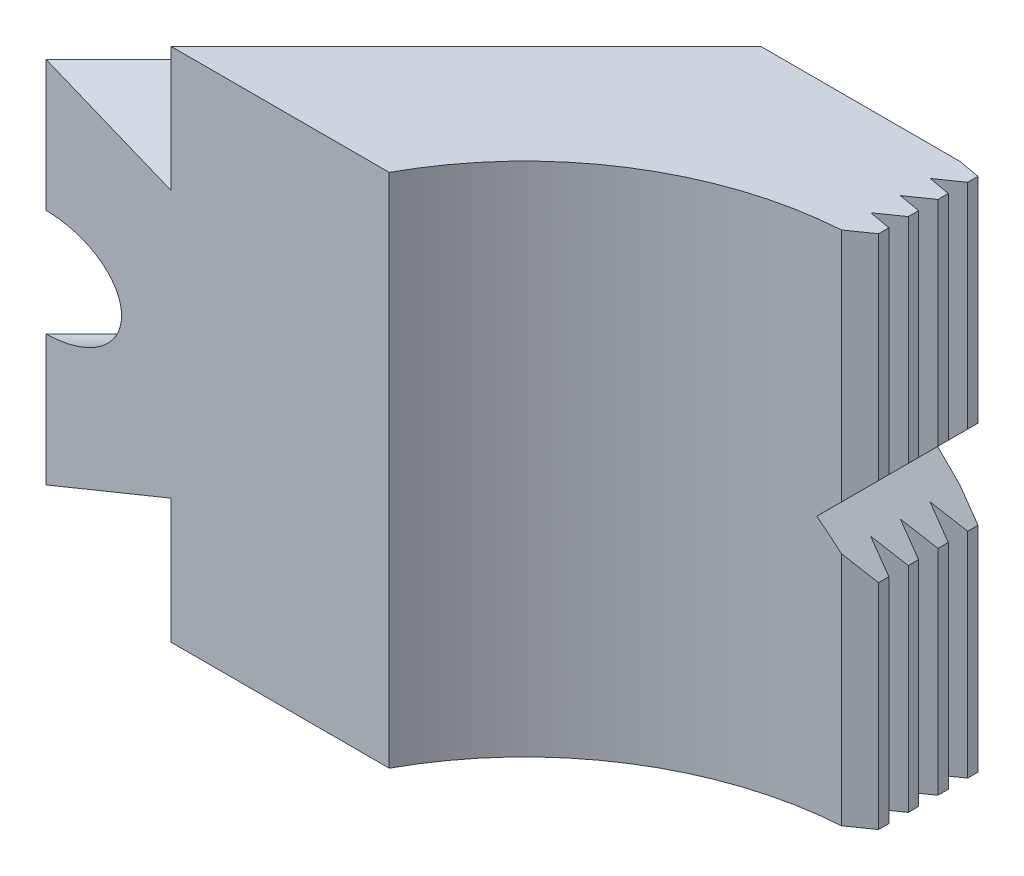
ISO-10303-21;
HEADER;
FILE_DESCRIPTION(('STEP AP214'),'2;1');
FILE_NAME('part.step','',(''),(''),'','','');
FILE_SCHEMA(('AUTOMOTIVE_DESIGN { 1 0 10303 214 1 1 1 1 }'));
ENDSEC;
DATA;
#1=APPLICATION_CONTEXT('core data for automotive mechanical design processes');
#2=APPLICATION_PROTOCOL_DEFINITION('international standard','automotive_design',2000,#1);
#3=PRODUCT_CONTEXT('',#1,'mechanical');
#4=PRODUCT('Part','Part','',(#3));
#5=PRODUCT_RELATED_PRODUCT_CATEGORY('part','',(#4));
#6=PRODUCT_DEFINITION_FORMATION('','',#4);
#7=PRODUCT_DEFINITION_CONTEXT('part definition',#1,'design');
#8=PRODUCT_DEFINITION('design','',#6,#7);
#9=PRODUCT_DEFINITION_SHAPE('','',#8);
#10=(LENGTH_UNIT() NAMED_UNIT(*) SI_UNIT(.MILLI.,.METRE.));
#11=(NAMED_UNIT(*) PLANE_ANGLE_UNIT() SI_UNIT($,.RADIAN.));
#12=(NAMED_UNIT(*) SI_UNIT($,.STERADIAN.) SOLID_ANGLE_UNIT());
#13=UNCERTAINTY_MEASURE_WITH_UNIT(LENGTH_MEASURE(1.E-05),#10,'distance_accuracy_value','');
#14=(GEOMETRIC_REPRESENTATION_CONTEXT(3) GLOBAL_UNCERTAINTY_ASSIGNED_CONTEXT((#13)) GLOBAL_UNIT_ASSIGNED_CONTEXT((#10,
#11,#12)) REPRESENTATION_CONTEXT('',''));
#15=CARTESIAN_POINT('',(0.,0.,0.));
#16=DIRECTION('',(0.,0.,1.));
#17=DIRECTION('',(1.,0.,0.));
#18=AXIS2_PLACEMENT_3D('',#15,#16,#17);
#19=CARTESIAN_POINT('',(-19.0016119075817,-7.084,8.977579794));
#20=DIRECTION('',(-0.707106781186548,0.,0.707106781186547));
#21=DIRECTION('',(0.707106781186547,0.,0.707106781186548));
#22=AXIS2_PLACEMENT_3D('',#19,#20,#21);
#23=PLANE('',#22);
#24=DIRECTION('',(0.,-1.,0.));
#25=VECTOR('',#24,1.);
#26=CARTESIAN_POINT('',(-16.1109196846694,1.73205081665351,11.8682720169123));
#27=LINE('',#26,#25);
#28=CARTESIAN_POINT('',(-16.1109196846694,1.73205081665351,11.8682720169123));
#29=VERTEX_POINT('',#28);
#30=CARTESIAN_POINT('',(-16.1109196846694,-1.7320508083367,11.8682720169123));
#31=VERTEX_POINT('',#30);
#32=EDGE_CURVE('E32',#29,#31,#27,.T.);
#33=ORIENTED_EDGE('',*,*,#32,.F.);
#34=DIRECTION('',(-0.612372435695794,-0.5,-0.612372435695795));
#35=VECTOR('',#34,1.);
#36=CARTESIAN_POINT('',(-13.98959934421,3.46410162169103,13.9895923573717));
#37=LINE('',#36,#35);
#38=CARTESIAN_POINT('',(-13.98959934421,3.46410162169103,13.9895923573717));
#39=VERTEX_POINT('',#38);
#40=EDGE_CURVE('E2131',#39,#29,#37,.T.);
#41=ORIENTED_EDGE('',*,*,#40,.F.);
#42=DIRECTION('',(-0.612372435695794,0.5,-0.612372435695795));
#43=VECTOR('',#42,1.);
#44=CARTESIAN_POINT('',(-11.8682789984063,1.73205081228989,16.1109127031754));
#45=LINE('',#44,#43);
#46=CARTESIAN_POINT('',(-11.8682789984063,1.73205081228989,16.1109127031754));
#47=VERTEX_POINT('',#46);
#48=EDGE_CURVE('E2134',#47,#39,#45,.T.);
#49=ORIENTED_EDGE('',*,*,#48,.F.);
#50=DIRECTION('',(0.,1.,0.));
#51=VECTOR('',#50,1.);
#52=CARTESIAN_POINT('',(-11.8682789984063,-1.73205080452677,16.1109127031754));
#53=LINE('',#52,#51);
#54=CARTESIAN_POINT('',(-11.8682789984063,-1.73205080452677,16.1109127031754));
#55=VERTEX_POINT('',#54);
#56=EDGE_CURVE('E2137',#55,#47,#53,.T.);
#57=ORIENTED_EDGE('',*,*,#56,.F.);
#58=DIRECTION('',(0.612372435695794,0.5,0.612372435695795));
#59=VECTOR('',#58,1.);
#60=CARTESIAN_POINT('',(-13.9895993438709,-3.46410161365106,13.9895923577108));
#61=LINE('',#60,#59);
#62=CARTESIAN_POINT('',(-13.9895993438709,-3.46410161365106,13.9895923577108));
#63=VERTEX_POINT('',#62);
#64=EDGE_CURVE('E2140',#63,#55,#61,.T.);
#65=ORIENTED_EDGE('',*,*,#64,.F.);
#66=DIRECTION('',(0.612372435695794,-0.5,0.612372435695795));
#67=VECTOR('',#66,1.);
#68=CARTESIAN_POINT('',(-16.1109196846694,-1.7320508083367,11.8682720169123));
#69=LINE('',#68,#67);
#70=EDGE_CURVE('E2143',#31,#63,#69,.T.);
#71=ORIENTED_EDGE('',*,*,#70,.F.);
#72=EDGE_LOOP('',(#33,#41,#49,#57,#65,#71));
#73=FACE_BOUND('',#72,.T.);
#74=CARTESIAN_POINT('',(-13.9895993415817,0.,13.98959236));
#75=DIRECTION('',(0.707106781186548,0.,-0.707106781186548));
#76=DIRECTION('',(-1.45034367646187E-10,1.,-1.45025753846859E-10));
#77=AXIS2_PLACEMENT_3D('',#74,#75,#76);
#78=CIRCLE('',#77,3.62500000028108);
#79=CARTESIAN_POINT('',(-11.4263372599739,2.82980586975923E-10,16.5528544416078));
#80=VERTEX_POINT('',#79);
#81=CARTESIAN_POINT('',(-13.9895937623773,3.62500000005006,13.9895979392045));
#82=VERTEX_POINT('',#81);
#83=EDGE_CURVE('E153',#80,#82,#78,.F.);
#84=ORIENTED_EDGE('',*,*,#83,.T.);
#85=DIRECTION('',(-2.45659811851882E-09,1.,-3.08384225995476E-09));
#86=VECTOR('',#85,1.);
#87=CARTESIAN_POINT('',(-13.9895937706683,6.99999986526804,13.9895979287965));
#88=LINE('',#87,#86);
#89=CARTESIAN_POINT('',(-13.9895937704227,6.90000000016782,13.9895979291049));
#90=VERTEX_POINT('',#89);
#91=EDGE_CURVE('E146',#82,#90,#88,.T.);
#92=ORIENTED_EDGE('',*,*,#91,.T.);
#93=CARTESIAN_POINT('',(-13.989593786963,-6.90000000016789,13.9895979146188));
#94=CARTESIAN_POINT('',(-14.3102671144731,-6.89996436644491,13.6689245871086));
#95=CARTESIAN_POINT('',(-14.6274629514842,-6.85578131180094,13.3517287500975));
#96=CARTESIAN_POINT('',(-15.2554305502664,-6.67905861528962,12.7237611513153));
#97=CARTESIAN_POINT('',(-15.5609594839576,-6.54806321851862,12.4182322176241));
#98=CARTESIAN_POINT('',(-16.1524820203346,-6.2014803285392,11.8267096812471));
#99=CARTESIAN_POINT('',(-16.4340695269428,-5.9887067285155,11.5451221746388));
#100=CARTESIAN_POINT('',(-16.9664151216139,-5.48558263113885,11.0127765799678));
#101=CARTESIAN_POINT('',(-17.2132399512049,-5.19920759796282,10.7659517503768));
#102=CARTESIAN_POINT('',(-17.6659508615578,-4.55887707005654,10.3132408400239));
#103=CARTESIAN_POINT('',(-17.868527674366,-4.20990583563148,10.1106640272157));
#104=CARTESIAN_POINT('',(-18.2242064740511,-3.45697642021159,9.75498522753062));
#105=CARTESIAN_POINT('',(-18.3747503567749,-3.05881975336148,9.60444134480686));
#106=CARTESIAN_POINT('',(-18.619728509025,-2.2222261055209,9.35946319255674));
#107=CARTESIAN_POINT('',(-18.7124541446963,-1.7901849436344,9.26673755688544));
#108=CARTESIAN_POINT('',(-18.8373172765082,-0.90207688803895,9.14187442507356));
#109=CARTESIAN_POINT('',(-18.8686612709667,-0.452754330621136,9.11053043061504));
#110=CARTESIAN_POINT('',(-18.868610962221,0.452738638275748,9.11058073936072));
#111=CARTESIAN_POINT('',(-18.8373687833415,0.902075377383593,9.1418229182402));
#112=CARTESIAN_POINT('',(-18.7124069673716,1.79015567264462,9.26678473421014));
#113=CARTESIAN_POINT('',(-18.6197792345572,2.22223883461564,9.35941246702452));
#114=CARTESIAN_POINT('',(-18.3747081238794,3.05877802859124,9.60448357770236));
#115=CARTESIAN_POINT('',(-18.224254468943,3.45700289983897,9.75493723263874));
#116=CARTESIAN_POINT('',(-17.8684920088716,4.20985326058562,10.1106996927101));
#117=CARTESIAN_POINT('',(-17.6659942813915,4.55891628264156,10.3131974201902));
#118=CARTESIAN_POINT('',(-17.2132122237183,5.19914619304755,10.7659794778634));
#119=CARTESIAN_POINT('',(-16.9664522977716,5.4856330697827,11.0127394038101));
#120=CARTESIAN_POINT('',(-16.4340508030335,5.98863885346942,11.5451408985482));
#121=CARTESIAN_POINT('',(-16.152511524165,6.20154005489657,11.8266801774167));
#122=CARTESIAN_POINT('',(-15.5609504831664,6.54799148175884,12.4182412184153));
#123=CARTESIAN_POINT('',(-15.2554512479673,6.67912533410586,12.7237404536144));
#124=CARTESIAN_POINT('',(-14.6274640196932,6.85570847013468,13.3517276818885));
#125=CARTESIAN_POINT('',(-14.3100016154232,6.89996439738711,13.6691900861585));
#126=CARTESIAN_POINT('',(-13.9895937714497,6.90000000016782,13.989597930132));
#127=B_SPLINE_CURVE_WITH_KNOTS('',3,(#93,#94,#95,#96,#97,#98,#99,#100,#101,#102,#103,#104,#105,
#106,#107,#108,#109,#110,#111,#112,#113,#114,#115,#116,#117,#118,#119,#120,#121,#122,#123,#124,
#125,#126),.UNSPECIFIED.,.F.,.F.,(4,2,2,2,2,2,2,2,2,2,2,2,2,2,2,2,4),(0.,0.0625,0.125,0.1875,
0.25,0.3125,0.375,0.4375,0.5,0.5625,0.625,0.6875,0.75,0.8125,0.875,0.9375,1.),.UNSPECIFIED.);
#128=CARTESIAN_POINT('',(-13.9895937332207,-6.90000000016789,13.989597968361));
#129=VERTEX_POINT('',#128);
#130=EDGE_CURVE('E18',#90,#129,#127,.F.);
#131=ORIENTED_EDGE('',*,*,#130,.T.);
#132=DIRECTION('',(-2.77021303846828E-09,1.,-2.77022734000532E-09));
#133=VECTOR('',#132,1.);
#134=CARTESIAN_POINT('',(-13.9895937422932,-3.6250001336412,13.9895979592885));
#135=LINE('',#134,#133);
#136=CARTESIAN_POINT('',(-13.9895937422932,-3.62499999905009,13.9895979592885));
#137=VERTEX_POINT('',#136);
#138=EDGE_CURVE('E901',#129,#137,#135,.T.);
#139=ORIENTED_EDGE('',*,*,#138,.T.);
#140=CARTESIAN_POINT('',(-13.9895993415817,0.,13.98959236));
#141=DIRECTION('',(0.707106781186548,0.,-0.707106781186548));
#142=DIRECTION('',(0.707106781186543,-1.79586368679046E-10,0.707106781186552));
#143=AXIS2_PLACEMENT_3D('',#140,#141,#142);
#144=CIRCLE('',#143,3.62500000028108);
#145=EDGE_CURVE('E231',#137,#80,#144,.F.);
#146=ORIENTED_EDGE('',*,*,#145,.T.);
#147=EDGE_LOOP('',(#84,#92,#131,#139,#146));
#148=FACE_BOUND('',#147,.T.);
#149=ADVANCED_FACE('F14',(#73,#148),#23,.T.);
#150=CARTESIAN_POINT('',(-81.5147255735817,-17.5,20.));
#151=DIRECTION('',(0.,0.,1.));
#152=DIRECTION('',(1.,0.,0.));
#153=AXIS2_PLACEMENT_3D('',#150,#151,#152);
#154=PLANE('',#153);
#155=DIRECTION('',(0.925820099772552,0.377964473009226,0.));
#156=VECTOR('',#155,1.);
#157=CARTESIAN_POINT('',(-74.476542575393,-34.7399570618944,20.));
#158=LINE('',#157,#156);
#159=CARTESIAN_POINT('',(-19.9999958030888,-12.5,20.0000000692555));
#160=VERTEX_POINT('',#159);
#161=CARTESIAN_POINT('',(-11.5147144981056,-9.03589838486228,20.));
#162=VERTEX_POINT('',#161);
#163=EDGE_CURVE('E2155',#160,#162,#158,.T.);
#164=ORIENTED_EDGE('',*,*,#163,.T.);
#165=DIRECTION('',(0.,-1.,0.));
#166=VECTOR('',#165,1.);
#167=CARTESIAN_POINT('',(-11.5147144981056,-17.5,20.));
#168=LINE('',#167,#166);
#169=CARTESIAN_POINT('',(-11.5147144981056,-17.5,20.));
#170=VERTEX_POINT('',#169);
#171=EDGE_CURVE('E2147',#162,#170,#168,.T.);
#172=ORIENTED_EDGE('',*,*,#171,.T.);
#173=CARTESIAN_POINT('',(3.28098316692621,-17.5,20.));
#174=DIRECTION('',(-1.,0.,0.));
#175=VECTOR('',#174,1.);
#176=LINE('',#173,#175);
#177=CARTESIAN_POINT('',(3.28098314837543,-17.5,20.0000000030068));
#178=VERTEX_POINT('',#177);
#179=EDGE_CURVE('E531',#178,#170,#176,.T.);
#180=ORIENTED_EDGE('',*,*,#179,.F.);
#181=CARTESIAN_POINT('',(3.28098313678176,17.5,20.0000000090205));
#182=CARTESIAN_POINT('',(3.28098313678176,16.0416666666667,20.0000000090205));
#183=CARTESIAN_POINT('',(3.28098313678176,14.5833333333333,20.0000000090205));
#184=CARTESIAN_POINT('',(3.28098313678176,11.6666666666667,20.0000000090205));
#185=CARTESIAN_POINT('',(3.28098313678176,10.2083333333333,20.0000000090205));
#186=CARTESIAN_POINT('',(3.28098313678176,7.29166666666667,20.0000000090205));
#187=CARTESIAN_POINT('',(3.28098313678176,5.83333333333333,20.0000000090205));
#188=CARTESIAN_POINT('',(3.28098313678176,2.91666666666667,20.0000000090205));
#189=CARTESIAN_POINT('',(3.28098313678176,1.45833333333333,20.0000000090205));
#190=CARTESIAN_POINT('',(3.28098313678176,-1.45833333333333,20.0000000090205));
#191=CARTESIAN_POINT('',(3.28098313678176,-2.91666666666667,20.0000000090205));
#192=CARTESIAN_POINT('',(3.28098313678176,-5.83333333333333,20.0000000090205));
#193=CARTESIAN_POINT('',(3.28098313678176,-7.29166666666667,20.0000000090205));
#194=CARTESIAN_POINT('',(3.28098313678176,-10.2083333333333,20.0000000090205));
#195=CARTESIAN_POINT('',(3.28098313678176,-11.6666666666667,20.0000000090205));
#196=CARTESIAN_POINT('',(3.28098313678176,-14.5833333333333,20.0000000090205));
#197=CARTESIAN_POINT('',(3.28098313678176,-16.0416666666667,20.0000000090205));
#198=CARTESIAN_POINT('',(3.28098313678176,-17.5,20.0000000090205));
#199=B_SPLINE_CURVE_WITH_KNOTS('',3,(#181,#182,#183,#184,#185,#186,#187,#188,#189,#190,#191,
#192,#193,#194,#195,#196,#197,#198),.UNSPECIFIED.,.F.,.F.,(4,2,2,2,2,2,2,2,4),(0.,4.375,8.75,
13.125,17.5,21.875,26.25,30.625,35.),.UNSPECIFIED.);
#200=CARTESIAN_POINT('',(3.28098314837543,17.5,20.0000000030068));
#201=VERTEX_POINT('',#200);
#202=EDGE_CURVE('E168',#178,#201,#199,.F.);
#203=ORIENTED_EDGE('',*,*,#202,.T.);
#204=CARTESIAN_POINT('',(3.28098316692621,17.5,20.));
#205=DIRECTION('',(-1.,0.,0.));
#206=VECTOR('',#205,1.);
#207=LINE('',#204,#206);
#208=CARTESIAN_POINT('',(-11.5147144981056,17.5,20.));
#209=VERTEX_POINT('',#208);
#210=EDGE_CURVE('E542',#201,#209,#207,.T.);
#211=ORIENTED_EDGE('',*,*,#210,.T.);
#212=DIRECTION('',(0.,-1.,0.));
#213=VECTOR('',#212,1.);
#214=CARTESIAN_POINT('',(-11.5147144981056,-17.5,20.));
#215=LINE('',#214,#213);
#216=CARTESIAN_POINT('',(-11.5147144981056,9.03589838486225,20.));
#217=VERTEX_POINT('',#216);
#218=EDGE_CURVE('E2159',#209,#217,#215,.T.);
#219=ORIENTED_EDGE('',*,*,#218,.T.);
#220=DIRECTION('',(-0.925820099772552,0.377964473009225,0.));
#221=VECTOR('',#220,1.);
#222=CARTESIAN_POINT('',(-62.2290938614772,29.7399570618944,20.));
#223=LINE('',#222,#221);
#224=CARTESIAN_POINT('',(-19.9999958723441,12.5,20.));
#225=VERTEX_POINT('',#224);
#226=EDGE_CURVE('E2157',#217,#225,#223,.T.);
#227=ORIENTED_EDGE('',*,*,#226,.T.);
#228=DIRECTION('',(5.54044037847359E-09,-1.,0.));
#229=VECTOR('',#228,1.);
#230=CARTESIAN_POINT('',(-19.9999957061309,-17.4999996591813,20.));
#231=LINE('',#230,#229);
#232=CARTESIAN_POINT('',(-19.9999986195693,6.99999999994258,20.0000027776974));
#233=VERTEX_POINT('',#232);
#234=EDGE_CURVE('E166',#225,#233,#231,.T.);
#235=ORIENTED_EDGE('',*,*,#234,.T.);
#236=CARTESIAN_POINT('',(-20.0000069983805,6.999999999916,20.));
#237=DIRECTION('',(0.,-1.,0.));
#238=VECTOR('',#237,1.);
#239=LINE('',#236,#238);
#240=CARTESIAN_POINT('',(-20.0000069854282,3.62500000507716,19.9999999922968));
#241=VERTEX_POINT('',#240);
#242=EDGE_CURVE('E140',#233,#241,#239,.T.);
#243=ORIENTED_EDGE('',*,*,#242,.T.);
#244=CARTESIAN_POINT('',(-14.8734828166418,0.,19.9999999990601));
#245=CARTESIAN_POINT('',(-14.8734797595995,0.0469065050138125,20.0000003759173));
#246=CARTESIAN_POINT('',(-14.8747789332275,0.0938116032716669,20.0000087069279));
#247=CARTESIAN_POINT('',(-14.8799598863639,0.187675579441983,20.0000336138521));
#248=CARTESIAN_POINT('',(-14.883852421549,0.234633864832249,20.00005022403));
#249=CARTESIAN_POINT('',(-14.8942270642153,0.328532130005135,20.000083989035));
#250=CARTESIAN_POINT('',(-14.9007237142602,0.375470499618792,20.0001011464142));
#251=CARTESIAN_POINT('',(-14.916307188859,0.469257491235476,20.0001308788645));
#252=CARTESIAN_POINT('',(-14.925412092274,0.516103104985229,20.0001434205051));
#253=CARTESIAN_POINT('',(-14.9462121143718,0.609632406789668,20.0001606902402));
#254=CARTESIAN_POINT('',(-14.9579285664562,0.65631134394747,20.0001653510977));
#255=CARTESIAN_POINT('',(-14.9839496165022,0.749434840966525,20.0001657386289));
#256=CARTESIAN_POINT('',(-14.9982784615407,0.795872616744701,20.0001613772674));
#257=CARTESIAN_POINT('',(-15.0295205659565,0.888440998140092,20.0001447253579));
#258=CARTESIAN_POINT('',(-15.0464606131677,0.93456255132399,20.0001323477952));
#259=CARTESIAN_POINT('',(-15.0829195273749,1.02642553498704,20.000102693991));
#260=CARTESIAN_POINT('',(-15.1024673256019,1.07215546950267,20.0000853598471));
#261=CARTESIAN_POINT('',(-15.1441346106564,1.16316181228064,20.0000514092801));
#262=CARTESIAN_POINT('',(-15.1662847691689,1.2084241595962,20.0000348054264));
#263=CARTESIAN_POINT('',(-15.2131468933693,1.29842286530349,20.0000084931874));
#264=CARTESIAN_POINT('',(-15.2378908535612,1.34314254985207,19.999998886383));
#265=CARTESIAN_POINT('',(-15.2885331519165,1.42959084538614,20.0000010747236));
#266=CARTESIAN_POINT('',(-15.3143486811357,1.4713680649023,20.0000120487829));
#267=CARTESIAN_POINT('',(-15.3684262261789,1.55460151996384,20.0000456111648));
#268=CARTESIAN_POINT('',(-15.3967291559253,1.59603114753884,20.0000684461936));
#269=CARTESIAN_POINT('',(-15.4557906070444,1.67849149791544,20.0001149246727));
#270=CARTESIAN_POINT('',(-15.4865895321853,1.71949324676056,20.0001385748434));
#271=CARTESIAN_POINT('',(-15.5506511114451,1.80101714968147,20.0001799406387));
#272=CARTESIAN_POINT('',(-15.5839534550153,1.84150808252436,20.0001975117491));
#273=CARTESIAN_POINT('',(-15.6530272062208,1.92192747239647,20.000222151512));
#274=CARTESIAN_POINT('',(-15.6888373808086,1.96182259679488,20.0002289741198));
#275=CARTESIAN_POINT('',(-15.7629296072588,2.04096532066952,20.0002303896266));
#276=CARTESIAN_POINT('',(-15.801249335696,2.08017761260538,20.0002247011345));
#277=CARTESIAN_POINT('',(-15.8803606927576,2.15786757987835,20.0002023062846));
#278=CARTESIAN_POINT('',(-15.9211887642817,2.19630810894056,20.0001853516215));
#279=CARTESIAN_POINT('',(-16.0053138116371,2.27236582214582,20.0001442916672));
#280=CARTESIAN_POINT('',(-16.0486458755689,2.30994416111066,20.0001200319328));
#281=CARTESIAN_POINT('',(-16.1377731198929,2.38418637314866,20.0000727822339));
#282=CARTESIAN_POINT('',(-16.1836019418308,2.42080981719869,20.0000498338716));
#283=CARTESIAN_POINT('',(-16.2777124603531,2.49305258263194,20.0000114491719));
#284=CARTESIAN_POINT('',(-16.3260262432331,2.52863008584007,19.9999961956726));
#285=CARTESIAN_POINT('',(-16.418534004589,2.59403801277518,20.0000033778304));
#286=CARTESIAN_POINT('',(-16.4625877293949,2.6240672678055,20.0000218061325));
#287=CARTESIAN_POINT('',(-16.5531718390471,2.68365185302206,20.0000805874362));
#288=CARTESIAN_POINT('',(-16.5997355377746,2.71315651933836,20.0001216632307));
#289=CARTESIAN_POINT('',(-16.6953569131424,2.77157897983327,20.0002053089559));
#290=CARTESIAN_POINT('',(-16.7444461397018,2.80044508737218,20.0002478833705));
#291=CARTESIAN_POINT('',(-16.845133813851,2.85747060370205,20.000323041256));
#292=CARTESIAN_POINT('',(-16.8967621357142,2.88557722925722,20.0003552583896));
#293=CARTESIAN_POINT('',(-17.0025381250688,2.94095976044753,20.0004011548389));
#294=CARTESIAN_POINT('',(-17.0567139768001,2.96818179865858,20.0004142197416));
#295=CARTESIAN_POINT('',(-17.1675903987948,3.02166644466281,20.0004184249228));
#296=CARTESIAN_POINT('',(-17.2243174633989,3.04787409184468,20.0004088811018));
#297=CARTESIAN_POINT('',(-17.3402963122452,3.09919703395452,20.0003694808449));
#298=CARTESIAN_POINT('',(-17.3995728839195,3.12425627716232,20.0003390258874));
#299=CARTESIAN_POINT('',(-17.520645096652,3.17314547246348,20.0002652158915));
#300=CARTESIAN_POINT('',(-17.5824637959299,3.19691828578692,20.0002215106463));
#301=CARTESIAN_POINT('',(-17.7086083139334,3.24309429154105,20.0001338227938));
#302=CARTESIAN_POINT('',(-17.7729554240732,3.26543927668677,20.0000898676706));
#303=CARTESIAN_POINT('',(-17.9041390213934,3.30861537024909,20.0000236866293));
#304=CARTESIAN_POINT('',(-17.9709950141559,3.32938720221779,20.0000020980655));
#305=CARTESIAN_POINT('',(-18.095010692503,3.36571180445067,19.9999982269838));
#306=CARTESIAN_POINT('',(-18.1520794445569,3.38157583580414,20.0000104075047));
#307=CARTESIAN_POINT('',(-18.2697139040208,3.41257734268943,20.0000333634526));
#308=CARTESIAN_POINT('',(-18.3303020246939,3.42762931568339,20.000044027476));
#309=CARTESIAN_POINT('',(-18.5220126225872,3.47243498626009,20.0000627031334));
#310=CARTESIAN_POINT('',(-18.6538706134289,3.49911675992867,20.0000534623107));
#311=CARTESIAN_POINT('',(-18.857362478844,3.53418553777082,20.0000073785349));
#312=CARTESIAN_POINT('',(-18.9285399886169,3.54531560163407,19.999985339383));
#313=CARTESIAN_POINT('',(-19.0482664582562,3.56215215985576,20.0000099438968));
#314=CARTESIAN_POINT('',(-19.0967321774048,3.5684518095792,20.0000367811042));
#315=CARTESIAN_POINT('',(-19.269140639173,3.58905865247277,20.0001193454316));
#316=CARTESIAN_POINT('',(-19.39342175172,3.60060995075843,20.0001552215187));
#317=CARTESIAN_POINT('',(-19.678378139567,3.6196432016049,20.0001647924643));
#318=CARTESIAN_POINT('',(-19.8391996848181,3.62498689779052,20.0001175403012));
#319=CARTESIAN_POINT('',(-20.0000069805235,3.62500000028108,19.9999999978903));
#320=B_SPLINE_CURVE_WITH_KNOTS('',3,(#244,#245,#246,#247,#248,#249,#250,#251,#252,#253,#254,
#255,#256,#257,#258,#259,#260,#261,#262,#263,#264,#265,#266,#267,#268,#269,#270,#271,#272,#273,
#274,#275,#276,#277,#278,#279,#280,#281,#282,#283,#284,#285,#286,#287,#288,#289,#290,#291,#292,
#293,#294,#295,#296,#297,#298,#299,#300,#301,#302,#303,#304,#305,#306,#307,#308,#309,#310,#311,
#312,#313,#314,#315,#316,#317,#318,#319),.UNSPECIFIED.,.F.,.F.,(4,2,2,2,2,2,2,2,2,2,2,2,2,2,2,2,
2,2,2,2,2,2,2,2,2,2,2,2,2,2,2,2,2,2,2,2,2,4),(0.,0.140699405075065,0.281986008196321,
0.424072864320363,0.567169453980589,0.711480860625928,0.857207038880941,1.00454218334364,
1.15367420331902,1.30478430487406,1.45804667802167,1.60532423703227,1.75579565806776,
1.90958733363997,2.06681764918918,2.22759739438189,2.39203018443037,2.56021288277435,
2.73223601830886,2.90818419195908,3.08813646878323,3.2480521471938,3.41339456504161,
3.58420562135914,3.76052331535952,3.94238219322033,4.12981373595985,4.32284669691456,
4.52150739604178,4.72581997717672,4.9358066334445,5.11348219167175,5.30075288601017,
5.70406628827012,5.92016534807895,6.06677686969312,6.44105145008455,6.92340218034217),.UNSPECIFIED.);
#321=CARTESIAN_POINT('',(-14.8734828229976,-2.17019483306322E-10,19.9999999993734));
#322=VERTEX_POINT('',#321);
#323=EDGE_CURVE('E163',#241,#322,#320,.F.);
#324=ORIENTED_EDGE('',*,*,#323,.T.);
#325=CARTESIAN_POINT('',(-20.0000069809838,-3.62500000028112,19.99999999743));
#326=CARTESIAN_POINT('',(-19.8391996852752,-3.6249868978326,20.0001175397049));
#327=CARTESIAN_POINT('',(-19.6783781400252,-3.61964320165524,20.0001647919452));
#328=CARTESIAN_POINT('',(-19.3934217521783,-3.60060995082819,20.0001552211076));
#329=CARTESIAN_POINT('',(-19.2691406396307,-3.58905865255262,20.0001193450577));
#330=CARTESIAN_POINT('',(-19.0967321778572,-3.56845180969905,20.000036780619));
#331=CARTESIAN_POINT('',(-19.0482664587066,-3.56215215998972,20.0000099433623));
#332=CARTESIAN_POINT('',(-18.9285399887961,-3.54531560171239,19.9999853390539));
#333=CARTESIAN_POINT('',(-18.8573624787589,-3.53418553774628,20.000007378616));
#334=CARTESIAN_POINT('',(-18.6538706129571,-3.49911675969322,20.0000534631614));
#335=CARTESIAN_POINT('',(-18.5220126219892,-3.47243498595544,20.0000627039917));
#336=CARTESIAN_POINT('',(-18.3303020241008,-3.42762931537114,20.0000440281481));
#337=CARTESIAN_POINT('',(-18.269713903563,-3.41257734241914,20.0000333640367));
#338=CARTESIAN_POINT('',(-18.1520794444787,-3.3815758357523,20.0000104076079));
#339=CARTESIAN_POINT('',(-18.0950106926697,-3.36571180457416,19.9999982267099));
#340=CARTESIAN_POINT('',(-17.9709950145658,-3.32938720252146,20.0000020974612));
#341=CARTESIAN_POINT('',(-17.9041390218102,-3.30861537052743,20.0000236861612));
#342=CARTESIAN_POINT('',(-17.7729554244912,-3.2654392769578,20.0000898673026));
#343=CARTESIAN_POINT('',(-17.7086083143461,-3.24309429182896,20.0001338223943));
#344=CARTESIAN_POINT('',(-17.582463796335,-3.19691828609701,20.0002215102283));
#345=CARTESIAN_POINT('',(-17.5206450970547,-3.1731454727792,20.0002652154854));
#346=CARTESIAN_POINT('',(-17.3995728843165,-3.12425627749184,20.0003390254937));
#347=CARTESIAN_POINT('',(-17.3402963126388,-3.09919703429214,20.0003694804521));
#348=CARTESIAN_POINT('',(-17.2243174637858,-3.04787409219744,20.000408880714));
#349=CARTESIAN_POINT('',(-17.1675903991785,-3.02166644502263,20.0004184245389));
#350=CARTESIAN_POINT('',(-17.056713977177,-2.96818179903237,20.0004142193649));
#351=CARTESIAN_POINT('',(-17.0025381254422,-2.94095976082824,20.0004011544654));
#352=CARTESIAN_POINT('',(-16.8967621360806,-2.88557722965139,20.0003552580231));
#353=CARTESIAN_POINT('',(-16.8451338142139,-2.85747060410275,20.0003230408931));
#354=CARTESIAN_POINT('',(-16.7444461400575,-2.80044508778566,20.0002478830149));
#355=CARTESIAN_POINT('',(-16.6953569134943,-2.77157898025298,20.000205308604));
#356=CARTESIAN_POINT('',(-16.5997355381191,-2.7131565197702,20.0001216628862));
#357=CARTESIAN_POINT('',(-16.5531718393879,-2.68365185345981,20.0000805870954));
#358=CARTESIAN_POINT('',(-16.4625877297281,-2.62406726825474,20.0000218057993));
#359=CARTESIAN_POINT('',(-16.4185340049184,-2.59403801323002,20.000003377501));
#360=CARTESIAN_POINT('',(-16.3260262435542,-2.52863008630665,19.9999961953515));
#361=CARTESIAN_POINT('',(-16.2777124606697,-2.49305258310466,20.0000114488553));
#362=CARTESIAN_POINT('',(-16.1836019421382,-2.42080981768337,20.0000498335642));
#363=CARTESIAN_POINT('',(-16.1377731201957,-2.38418637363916,20.0000727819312));
#364=CARTESIAN_POINT('',(-16.0486458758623,-2.30994416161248,20.0001200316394));
#365=CARTESIAN_POINT('',(-16.0053138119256,-2.27236582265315,20.0001442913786));
#366=CARTESIAN_POINT('',(-15.9211887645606,-2.19630810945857,20.0001853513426));
#367=CARTESIAN_POINT('',(-15.8803606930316,-2.15786758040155,20.0002023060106));
#368=CARTESIAN_POINT('',(-15.8012493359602,-2.08017761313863,20.0002247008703));
#369=CARTESIAN_POINT('',(-15.762929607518,-2.04096532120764,20.0002303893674));
#370=CARTESIAN_POINT('',(-15.6888373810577,-1.9618225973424,20.0002289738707));
#371=CARTESIAN_POINT('',(-15.6530272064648,-1.92192747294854,20.0002221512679));
#372=CARTESIAN_POINT('',(-15.5839534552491,-1.84150808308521,20.0001975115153));
#373=CARTESIAN_POINT('',(-15.5506511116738,-1.80101715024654,20.00017994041));
#374=CARTESIAN_POINT('',(-15.4865895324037,-1.71949324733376,20.000138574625));
#375=CARTESIAN_POINT('',(-15.4557906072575,-1.67849149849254,20.0001149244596));
#376=CARTESIAN_POINT('',(-15.3967291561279,-1.59603114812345,20.0000684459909));
#377=CARTESIAN_POINT('',(-15.3684262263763,-1.55460152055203,20.0000456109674));
#378=CARTESIAN_POINT('',(-15.3143486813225,-1.47136806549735,20.000012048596));
#379=CARTESIAN_POINT('',(-15.2885331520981,-1.42959084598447,20.000001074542));
#380=CARTESIAN_POINT('',(-15.2378908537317,-1.34314255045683,19.9999988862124));
#381=CARTESIAN_POINT('',(-15.2131468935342,-1.29842286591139,20.0000084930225));
#382=CARTESIAN_POINT('',(-15.1662847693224,-1.20842416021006,20.000034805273));
#383=CARTESIAN_POINT('',(-15.1441346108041,-1.16316181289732,20.0000514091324));
#384=CARTESIAN_POINT('',(-15.1024673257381,-1.07215547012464,20.000085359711));
#385=CARTESIAN_POINT('',(-15.0829195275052,-1.02642553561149,20.0001026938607));
#386=CARTESIAN_POINT('',(-15.0464606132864,-0.934562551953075,20.0001323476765));
#387=CARTESIAN_POINT('',(-15.0295205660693,-0.888440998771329,20.0001447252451));
#388=CARTESIAN_POINT('',(-14.9982784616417,-0.795872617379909,20.0001613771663));
#389=CARTESIAN_POINT('',(-14.9839496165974,-0.749434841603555,20.0001657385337));
#390=CARTESIAN_POINT('',(-14.9579285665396,-0.656311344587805,20.0001653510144));
#391=CARTESIAN_POINT('',(-14.9462121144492,-0.60963240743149,20.0001606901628));
#392=CARTESIAN_POINT('',(-14.9254120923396,-0.516103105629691,20.0001434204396));
#393=CARTESIAN_POINT('',(-14.9163071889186,-0.469257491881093,20.0001308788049));
#394=CARTESIAN_POINT('',(-14.9007237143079,-0.375470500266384,20.0001011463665));
#395=CARTESIAN_POINT('',(-14.894227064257,-0.32853213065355,20.0000839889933));
#396=CARTESIAN_POINT('',(-14.8838524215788,-0.234633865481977,20.0000502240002));
#397=CARTESIAN_POINT('',(-14.8799598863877,-0.187675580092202,20.0000336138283));
#398=CARTESIAN_POINT('',(-14.8747789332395,-0.093811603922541,20.000008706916));
#399=CARTESIAN_POINT('',(-14.8734797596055,-0.0469065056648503,20.0000003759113));
#400=CARTESIAN_POINT('',(-14.8734828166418,-6.51018801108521E-10,19.9999999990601));
#401=B_SPLINE_CURVE_WITH_KNOTS('',3,(#325,#326,#327,#328,#329,#330,#331,#332,#333,#334,#335,
#336,#337,#338,#339,#340,#341,#342,#343,#344,#345,#346,#347,#348,#349,#350,#351,#352,#353,#354,
#355,#356,#357,#358,#359,#360,#361,#362,#363,#364,#365,#366,#367,#368,#369,#370,#371,#372,#373,
#374,#375,#376,#377,#378,#379,#380,#381,#382,#383,#384,#385,#386,#387,#388,#389,#390,#391,#392,
#393,#394,#395,#396,#397,#398,#399,#400),.UNSPECIFIED.,.F.,.F.,(4,2,2,2,2,2,2,2,2,2,2,2,2,2,2,2,
2,2,2,2,2,2,2,2,2,2,2,2,2,2,2,2,2,2,2,2,2,4),(0.,0.482350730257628,0.856625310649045,
1.00323683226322,1.21933589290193,1.62264929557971,1.80991998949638,1.98759554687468,
2.19758220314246,2.4018947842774,2.60055548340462,2.79358844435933,2.98101998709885,
3.16287886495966,3.33919655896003,3.51000761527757,3.67535003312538,3.83526571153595,
4.0152179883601,4.19116616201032,4.36318929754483,4.53137199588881,4.69580478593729,
4.85658453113,5.01381484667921,5.16760652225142,5.31807794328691,5.46535550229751,
5.61861787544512,5.76972797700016,5.91885999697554,6.06619514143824,6.21192131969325,
6.35623272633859,6.49932931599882,6.64141617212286,6.78270277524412,6.92340218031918),.UNSPECIFIED.);
#402=CARTESIAN_POINT('',(-20.0000013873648,-3.6250000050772,20.0000056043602));
#403=VERTEX_POINT('',#402);
#404=EDGE_CURVE('E175',#322,#403,#401,.F.);
#405=ORIENTED_EDGE('',*,*,#404,.T.);
#406=CARTESIAN_POINT('',(-20.0000069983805,-3.62500001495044,20.));
#407=DIRECTION('',(0.,-1.,0.));
#408=VECTOR('',#407,1.);
#409=LINE('',#406,#408);
#410=CARTESIAN_POINT('',(-19.9999985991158,-6.99999999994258,20.0000028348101));
#411=VERTEX_POINT('',#410);
#412=EDGE_CURVE('E965',#403,#411,#409,.T.);
#413=ORIENTED_EDGE('',*,*,#412,.T.);
#414=DIRECTION('',(0.,-1.,0.));
#415=VECTOR('',#414,1.);
#416=CARTESIAN_POINT('',(-19.9999958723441,-17.5,20.));
#417=LINE('',#416,#415);
#418=EDGE_CURVE('E1983',#411,#160,#417,.T.);
#419=ORIENTED_EDGE('',*,*,#418,.T.);
#420=EDGE_LOOP('',(#164,#172,#180,#203,#211,#219,#227,#235,#243,#324,#405,#413,#419));
#421=FACE_BOUND('',#420,.T.);
#422=ADVANCED_FACE('F161',(#421),#154,.T.);
#423=CARTESIAN_POINT('',(-81.5147255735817,17.5,20.));
#424=DIRECTION('',(0.,-1.,0.));
#425=DIRECTION('',(0.,0.,-1.));
#426=AXIS2_PLACEMENT_3D('',#423,#424,#425);
#427=PLANE('',#426);
#428=DIRECTION('',(0.707106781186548,0.,-0.707106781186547));
#429=VECTOR('',#428,1.);
#430=CARTESIAN_POINT('',(-46.5147200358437,17.5,55.0000055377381));
#431=LINE('',#430,#429);
#432=CARTESIAN_POINT('',(8.48528550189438,17.5,0.));
#433=VERTEX_POINT('',#432);
#434=EDGE_CURVE('E550',#209,#433,#431,.T.);
#435=ORIENTED_EDGE('',*,*,#434,.F.);
#436=ORIENTED_EDGE('',*,*,#210,.F.);
#437=CARTESIAN_POINT('',(23.4799930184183,17.5,31.));
#438=DIRECTION('',(0.,1.,0.));
#439=DIRECTION('',(-0.064516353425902,0.,-0.997916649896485));
#440=AXIS2_PLACEMENT_3D('',#437,#438,#439);
#441=CIRCLE('',#440,23.);
#442=CARTESIAN_POINT('',(21.9961169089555,17.5,8.04791704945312));
#443=VERTEX_POINT('',#442);
#444=EDGE_CURVE('E298',#443,#201,#441,.T.);
#445=ORIENTED_EDGE('',*,*,#444,.F.);
#446=CARTESIAN_POINT('',(23.4799930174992,17.5,7.00889580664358));
#447=DIRECTION('',(-0.819152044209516,0.,0.57357643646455));
#448=VECTOR('',#447,1.);
#449=LINE('',#446,#448);
#450=CARTESIAN_POINT('',(23.4799930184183,17.5,7.00889580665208));
#451=VERTEX_POINT('',#450);
#452=EDGE_CURVE('E397',#451,#443,#449,.T.);
#453=ORIENTED_EDGE('',*,*,#452,.F.);
#454=CARTESIAN_POINT('',(23.4799930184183,17.5,6.3088958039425));
#455=DIRECTION('',(0.,0.,1.));
#456=VECTOR('',#455,1.);
#457=LINE('',#454,#456);
#458=CARTESIAN_POINT('',(23.4799930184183,17.5,6.30889580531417));
#459=VERTEX_POINT('',#458);
#460=EDGE_CURVE('E360',#459,#451,#457,.T.);
#461=ORIENTED_EDGE('',*,*,#460,.F.);
#462=DIRECTION('',(0.984807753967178,0.,0.173648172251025));
#463=VECTOR('',#462,1.);
#464=CARTESIAN_POINT('',(21.9799930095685,17.5,6.04440534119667));
#465=LINE('',#464,#463);
#466=CARTESIAN_POINT('',(21.9799930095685,17.5,6.04440534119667));
#467=VERTEX_POINT('',#466);
#468=EDGE_CURVE('E1224',#467,#459,#465,.T.);
#469=ORIENTED_EDGE('',*,*,#468,.F.);
#470=DIRECTION('',(-0.819152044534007,0.,0.573576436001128));
#471=VECTOR('',#470,1.);
#472=CARTESIAN_POINT('',(23.4799930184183,17.5,4.99409402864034));
#473=LINE('',#472,#471);
#474=CARTESIAN_POINT('',(23.4799930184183,17.5,4.99409402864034));
#475=VERTEX_POINT('',#474);
#476=EDGE_CURVE('E1220',#475,#467,#473,.T.);
#477=ORIENTED_EDGE('',*,*,#476,.F.);
#478=CARTESIAN_POINT('',(23.4799930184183,17.5,4.29409402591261));
#479=DIRECTION('',(0.,0.,1.));
#480=VECTOR('',#479,1.);
#481=LINE('',#478,#480);
#482=CARTESIAN_POINT('',(23.4799930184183,17.5,4.29409402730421));
#483=VERTEX_POINT('',#482);
#484=EDGE_CURVE('E997',#483,#475,#481,.T.);
#485=ORIENTED_EDGE('',*,*,#484,.F.);
#486=DIRECTION('',(0.984807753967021,0.,0.173648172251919));
#487=VECTOR('',#486,1.);
#488=CARTESIAN_POINT('',(21.9799930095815,17.5,4.0296035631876));
#489=LINE('',#488,#487);
#490=CARTESIAN_POINT('',(21.9799930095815,17.5,4.0296035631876));
#491=VERTEX_POINT('',#490);
#492=EDGE_CURVE('E1166',#491,#483,#489,.T.);
#493=ORIENTED_EDGE('',*,*,#492,.F.);
#494=DIRECTION('',(-0.819152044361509,0.,0.573576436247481));
#495=VECTOR('',#494,1.);
#496=CARTESIAN_POINT('',(23.4799930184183,17.5,2.97929224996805));
#497=LINE('',#496,#495);
#498=CARTESIAN_POINT('',(23.4799930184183,17.5,2.97929224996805));
#499=VERTEX_POINT('',#498);
#500=EDGE_CURVE('E1157',#499,#491,#497,.T.);
#501=ORIENTED_EDGE('',*,*,#500,.F.);
#502=CARTESIAN_POINT('',(23.4799930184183,17.5,2.27929224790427));
#503=DIRECTION('',(0.,0.,1.));
#504=VECTOR('',#503,1.);
#505=LINE('',#502,#504);
#506=CARTESIAN_POINT('',(23.4799930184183,17.5,2.27929224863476));
#507=VERTEX_POINT('',#506);
#508=EDGE_CURVE('E1105',#507,#499,#505,.T.);
#509=ORIENTED_EDGE('',*,*,#508,.F.);
#510=DIRECTION('',(0.984807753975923,0.,0.173648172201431));
#511=VECTOR('',#510,1.);
#512=CARTESIAN_POINT('',(21.9799930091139,17.5,2.014801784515));
#513=LINE('',#512,#511);
#514=CARTESIAN_POINT('',(21.9799930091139,17.5,2.014801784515));
#515=VERTEX_POINT('',#514);
#516=EDGE_CURVE('E1178',#515,#507,#513,.T.);
#517=ORIENTED_EDGE('',*,*,#516,.F.);
#518=DIRECTION('',(-0.819152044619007,0.,0.573576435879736));
#519=VECTOR('',#518,1.);
#520=CARTESIAN_POINT('',(23.4799930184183,17.5,0.96449047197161));
#521=LINE('',#520,#519);
#522=CARTESIAN_POINT('',(23.4799930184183,17.5,0.96449047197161));
#523=VERTEX_POINT('',#522);
#524=EDGE_CURVE('E1174',#523,#515,#521,.T.);
#525=ORIENTED_EDGE('',*,*,#524,.F.);
#526=CARTESIAN_POINT('',(23.4799930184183,17.5,0.26449046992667));
#527=DIRECTION('',(0.,0.,1.));
#528=VECTOR('',#527,1.);
#529=LINE('',#526,#528);
#530=CARTESIAN_POINT('',(23.4799930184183,17.5,0.264490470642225));
#531=VERTEX_POINT('',#530);
#532=EDGE_CURVE('E1153',#531,#523,#529,.T.);
#533=ORIENTED_EDGE('',*,*,#532,.F.);
#534=CARTESIAN_POINT('',(21.9799930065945,17.5,-2.08485680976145E-09));
#535=DIRECTION('',(0.984807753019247,0.,0.173648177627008));
#536=VECTOR('',#535,1.);
#537=LINE('',#534,#536);
#538=CARTESIAN_POINT('',(21.9799930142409,17.5,6.44124944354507E-10));
#539=VERTEX_POINT('',#538);
#540=EDGE_CURVE('E622',#539,#531,#537,.T.);
#541=ORIENTED_EDGE('',*,*,#540,.F.);
#542=CARTESIAN_POINT('',(21.9799930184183,17.5,0.));
#543=DIRECTION('',(-1.,0.,0.));
#544=VECTOR('',#543,1.);
#545=LINE('',#542,#544);
#546=EDGE_CURVE('E632',#539,#433,#545,.T.);
#547=ORIENTED_EDGE('',*,*,#546,.T.);
#548=EDGE_LOOP('',(#435,#436,#445,#453,#461,#469,#477,#485,#493,#501,#509,#517,#525,#533,#541,#547));
#549=FACE_BOUND('',#548,.T.);
#550=ADVANCED_FACE('F495',(#549),#427,.F.);
#551=CARTESIAN_POINT('',(-81.5147255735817,-17.5,20.));
#552=DIRECTION('',(0.,-1.,0.));
#553=DIRECTION('',(0.,0.,-1.));
#554=AXIS2_PLACEMENT_3D('',#551,#552,#553);
#555=PLANE('',#554);
#556=ORIENTED_EDGE('',*,*,#179,.T.);
#557=DIRECTION('',(0.707106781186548,0.,-0.707106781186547));
#558=VECTOR('',#557,1.);
#559=CARTESIAN_POINT('',(-46.5147200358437,-17.5,55.0000055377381));
#560=LINE('',#559,#558);
#561=CARTESIAN_POINT('',(8.48528550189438,-17.5,0.));
#562=VERTEX_POINT('',#561);
#563=EDGE_CURVE('E2151',#170,#562,#560,.T.);
#564=ORIENTED_EDGE('',*,*,#563,.T.);
#565=CARTESIAN_POINT('',(8.48528550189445,-17.5,0.));
#566=DIRECTION('',(1.,0.,0.));
#567=VECTOR('',#566,1.);
#568=LINE('',#565,#567);
#569=CARTESIAN_POINT('',(21.9799930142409,-17.5,6.44124944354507E-10));
#570=VERTEX_POINT('',#569);
#571=EDGE_CURVE('E41',#562,#570,#568,.T.);
#572=ORIENTED_EDGE('',*,*,#571,.T.);
#573=CARTESIAN_POINT('',(23.4799930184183,-17.5,0.264490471));
#574=DIRECTION('',(-0.984807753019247,0.,-0.173648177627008));
#575=VECTOR('',#574,1.);
#576=LINE('',#573,#575);
#577=CARTESIAN_POINT('',(23.4799930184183,-17.5,0.264490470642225));
#578=VERTEX_POINT('',#577);
#579=EDGE_CURVE('E663',#578,#570,#576,.T.);
#580=ORIENTED_EDGE('',*,*,#579,.F.);
#581=CARTESIAN_POINT('',(23.4799930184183,-17.5,0.264490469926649));
#582=DIRECTION('',(0.,0.,1.));
#583=VECTOR('',#582,1.);
#584=LINE('',#581,#583);
#585=CARTESIAN_POINT('',(23.4799930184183,-17.5,0.96449047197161));
#586=VERTEX_POINT('',#585);
#587=EDGE_CURVE('E552',#578,#586,#584,.T.);
#588=ORIENTED_EDGE('',*,*,#587,.T.);
#589=DIRECTION('',(0.81915204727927,0.,-0.573576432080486));
#590=VECTOR('',#589,1.);
#591=CARTESIAN_POINT('',(21.9799930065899,-17.5,2.01480177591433));
#592=LINE('',#591,#590);
#593=CARTESIAN_POINT('',(21.9799930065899,-17.5,2.01480177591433));
#594=VERTEX_POINT('',#593);
#595=EDGE_CURVE('E735',#594,#586,#592,.T.);
#596=ORIENTED_EDGE('',*,*,#595,.F.);
#597=DIRECTION('',(-0.984807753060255,0.,-0.173648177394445));
#598=VECTOR('',#597,1.);
#599=CARTESIAN_POINT('',(23.4799930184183,-17.5,2.27929224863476));
#600=LINE('',#599,#598);
#601=CARTESIAN_POINT('',(23.4799930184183,-17.5,2.27929224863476));
#602=VERTEX_POINT('',#601);
#603=EDGE_CURVE('E1186',#602,#594,#600,.T.);
#604=ORIENTED_EDGE('',*,*,#603,.F.);
#605=CARTESIAN_POINT('',(23.4799930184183,-17.5,2.2792922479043));
#606=DIRECTION('',(0.,0.,1.));
#607=VECTOR('',#606,1.);
#608=LINE('',#605,#607);
#609=CARTESIAN_POINT('',(23.4799930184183,-17.5,2.97929224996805));
#610=VERTEX_POINT('',#609);
#611=EDGE_CURVE('E711',#602,#610,#608,.T.);
#612=ORIENTED_EDGE('',*,*,#611,.T.);
#613=DIRECTION('',(0.81915204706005,0.,-0.573576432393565));
#614=VECTOR('',#613,1.);
#615=CARTESIAN_POINT('',(21.9799930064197,-17.5,4.02960355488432));
#616=LINE('',#615,#614);
#617=CARTESIAN_POINT('',(21.9799930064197,-17.5,4.02960355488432));
#618=VERTEX_POINT('',#617);
#619=EDGE_CURVE('E1200',#618,#610,#616,.T.);
#620=ORIENTED_EDGE('',*,*,#619,.F.);
#621=DIRECTION('',(-0.984807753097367,0.,-0.173648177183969));
#622=VECTOR('',#621,1.);
#623=CARTESIAN_POINT('',(23.4799930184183,-17.5,4.29409402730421));
#624=LINE('',#623,#622);
#625=CARTESIAN_POINT('',(23.4799930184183,-17.5,4.29409402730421));
#626=VERTEX_POINT('',#625);
#627=EDGE_CURVE('E1196',#626,#618,#624,.T.);
#628=ORIENTED_EDGE('',*,*,#627,.F.);
#629=CARTESIAN_POINT('',(23.4799930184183,-17.5,4.2940940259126));
#630=DIRECTION('',(0.,0.,1.));
#631=VECTOR('',#630,1.);
#632=LINE('',#629,#631);
#633=CARTESIAN_POINT('',(23.4799930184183,-17.5,4.99409402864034));
#634=VERTEX_POINT('',#633);
#635=EDGE_CURVE('E702',#626,#634,#632,.T.);
#636=ORIENTED_EDGE('',*,*,#635,.T.);
#637=DIRECTION('',(0.819152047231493,0.,-0.573576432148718));
#638=VECTOR('',#637,1.);
#639=CARTESIAN_POINT('',(21.9799930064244,-17.5,6.04440533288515));
#640=LINE('',#639,#638);
#641=CARTESIAN_POINT('',(21.9799930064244,-17.5,6.04440533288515));
#642=VERTEX_POINT('',#641);
#643=EDGE_CURVE('E1212',#642,#634,#640,.T.);
#644=ORIENTED_EDGE('',*,*,#643,.F.);
#645=DIRECTION('',(-0.984807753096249,0.,-0.17364817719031));
#646=VECTOR('',#645,1.);
#647=CARTESIAN_POINT('',(23.4799930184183,-17.5,6.30889580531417));
#648=LINE('',#647,#646);
#649=CARTESIAN_POINT('',(23.4799930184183,-17.5,6.30889580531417));
#650=VERTEX_POINT('',#649);
#651=EDGE_CURVE('E1208',#650,#642,#648,.T.);
#652=ORIENTED_EDGE('',*,*,#651,.F.);
#653=CARTESIAN_POINT('',(23.4799930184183,-17.5,6.3088958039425));
#654=DIRECTION('',(0.,0.,1.));
#655=VECTOR('',#654,1.);
#656=LINE('',#653,#655);
#657=CARTESIAN_POINT('',(23.4799930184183,-17.5,7.00889580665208));
#658=VERTEX_POINT('',#657);
#659=EDGE_CURVE('E696',#650,#658,#656,.T.);
#660=ORIENTED_EDGE('',*,*,#659,.T.);
#661=CARTESIAN_POINT('',(23.4799930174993,-17.5,7.00889580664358));
#662=DIRECTION('',(-0.819152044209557,0.,0.57357643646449));
#663=VECTOR('',#662,1.);
#664=LINE('',#661,#663);
#665=CARTESIAN_POINT('',(21.9961169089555,-17.5,8.04791704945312));
#666=VERTEX_POINT('',#665);
#667=EDGE_CURVE('E442',#658,#666,#664,.T.);
#668=ORIENTED_EDGE('',*,*,#667,.T.);
#669=CARTESIAN_POINT('',(23.4799930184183,-17.5,31.));
#670=DIRECTION('',(0.,-1.,0.));
#671=DIRECTION('',(-0.878217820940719,0.,-0.478260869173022));
#672=AXIS2_PLACEMENT_3D('',#669,#670,#671);
#673=CIRCLE('',#672,23.);
#674=EDGE_CURVE('E274',#666,#178,#673,.F.);
#675=ORIENTED_EDGE('',*,*,#674,.T.);
#676=EDGE_LOOP('',(#556,#564,#572,#580,#588,#596,#604,#612,#620,#628,#636,#644,#652,#660,#668,#675));
#677=FACE_BOUND('',#676,.T.);
#678=ADVANCED_FACE('F571',(#677),#555,.T.);
#679=CARTESIAN_POINT('',(-11.5147255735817,-17.5,0.));
#680=DIRECTION('',(0.,0.,1.));
#681=DIRECTION('',(1.,0.,0.));
#682=AXIS2_PLACEMENT_3D('',#679,#680,#681);
#683=PLANE('',#682);
#684=DIRECTION('',(0.,-1.,0.));
#685=VECTOR('',#684,1.);
#686=CARTESIAN_POINT('',(8.48528550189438,-17.5,0.));
#687=LINE('',#686,#685);
#688=CARTESIAN_POINT('',(8.48528550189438,-9.03589838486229,0.));
#689=VERTEX_POINT('',#688);
#690=EDGE_CURVE('E9',#689,#562,#687,.T.);
#691=ORIENTED_EDGE('',*,*,#690,.F.);
#692=DIRECTION('',(0.925820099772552,0.377964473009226,0.));
#693=VECTOR('',#692,1.);
#694=CARTESIAN_POINT('',(-11.6193997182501,-17.2436017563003,0.));
#695=LINE('',#694,#693);
#696=CARTESIAN_POINT('',(4.19691129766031E-06,-12.5,6.92554655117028E-08));
#697=VERTEX_POINT('',#696);
#698=EDGE_CURVE('E24',#697,#689,#695,.T.);
#699=ORIENTED_EDGE('',*,*,#698,.F.);
#700=CARTESIAN_POINT('',(4.12765581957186E-06,-12.5,0.));
#701=DIRECTION('',(0.,1.,0.));
#702=VECTOR('',#701,1.);
#703=LINE('',#700,#702);
#704=CARTESIAN_POINT('',(-1.37410908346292E-06,-6.99999999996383,5.60980344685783E-06));
#705=VERTEX_POINT('',#704);
#706=EDGE_CURVE('E891',#697,#705,#703,.T.);
#707=ORIENTED_EDGE('',*,*,#706,.T.);
#708=CARTESIAN_POINT('',(-6.97953832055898E-06,-6.999999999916,0.));
#709=DIRECTION('',(0.,1.,0.));
#710=VECTOR('',#709,1.);
#711=LINE('',#708,#710);
#712=CARTESIAN_POINT('',(1.37410908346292E-06,6.99999999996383,2.78401911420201E-06));
#713=VERTEX_POINT('',#712);
#714=EDGE_CURVE('E843',#705,#713,#711,.T.);
#715=ORIENTED_EDGE('',*,*,#714,.T.);
#716=DIRECTION('',(5.54044037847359E-09,-1.,0.));
#717=VECTOR('',#716,1.);
#718=CARTESIAN_POINT('',(4.29386902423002E-06,-17.4999999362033,0.));
#719=LINE('',#718,#717);
#720=CARTESIAN_POINT('',(4.12765583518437E-06,12.5,0.));
#721=VERTEX_POINT('',#720);
#722=EDGE_CURVE('E2188',#721,#713,#719,.T.);
#723=ORIENTED_EDGE('',*,*,#722,.F.);
#724=DIRECTION('',(-0.925820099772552,0.377964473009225,0.));
#725=VECTOR('',#724,1.);
#726=CARTESIAN_POINT('',(0.628048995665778,12.2436017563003,0.));
#727=LINE('',#726,#725);
#728=CARTESIAN_POINT('',(8.48528550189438,9.03589838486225,0.));
#729=VERTEX_POINT('',#728);
#730=EDGE_CURVE('E868',#729,#721,#727,.T.);
#731=ORIENTED_EDGE('',*,*,#730,.F.);
#732=DIRECTION('',(0.,-1.,0.));
#733=VECTOR('',#732,1.);
#734=CARTESIAN_POINT('',(8.48528550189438,-17.5,0.));
#735=LINE('',#734,#733);
#736=EDGE_CURVE('E865',#433,#729,#735,.T.);
#737=ORIENTED_EDGE('',*,*,#736,.F.);
#738=ORIENTED_EDGE('',*,*,#546,.F.);
#739=CARTESIAN_POINT('',(21.9799930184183,1.50000000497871,0.));
#740=DIRECTION('',(0.,1.,0.));
#741=VECTOR('',#740,1.);
#742=LINE('',#739,#741);
#743=CARTESIAN_POINT('',(21.9799930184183,1.50000000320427,0.));
#744=VERTEX_POINT('',#743);
#745=EDGE_CURVE('E640',#744,#539,#742,.T.);
#746=ORIENTED_EDGE('',*,*,#745,.F.);
#747=CARTESIAN_POINT('',(20.4799930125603,-5.85796732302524E-09,0.));
#748=DIRECTION('',(0.707106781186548,0.707106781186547,0.));
#749=VECTOR('',#748,1.);
#750=LINE('',#747,#749);
#751=CARTESIAN_POINT('',(20.479993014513,0.,0.));
#752=VERTEX_POINT('',#751);
#753=EDGE_CURVE('E647',#752,#744,#750,.T.);
#754=ORIENTED_EDGE('',*,*,#753,.F.);
#755=CARTESIAN_POINT('',(21.9799930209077,-1.50000000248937,0.));
#756=DIRECTION('',(-0.707106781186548,0.707106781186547,0.));
#757=VECTOR('',#756,1.);
#758=LINE('',#755,#757);
#759=CARTESIAN_POINT('',(21.9799930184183,-1.50000000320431,0.));
#760=VERTEX_POINT('',#759);
#761=EDGE_CURVE('E653',#760,#752,#758,.T.);
#762=ORIENTED_EDGE('',*,*,#761,.F.);
#763=CARTESIAN_POINT('',(21.9799930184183,-17.5,0.));
#764=DIRECTION('',(0.,1.,0.));
#765=VECTOR('',#764,1.);
#766=LINE('',#763,#765);
#767=EDGE_CURVE('E646',#570,#760,#766,.T.);
#768=ORIENTED_EDGE('',*,*,#767,.F.);
#769=ORIENTED_EDGE('',*,*,#571,.F.);
#770=EDGE_LOOP('',(#691,#699,#707,#715,#723,#731,#737,#738,#746,#754,#762,#768,#769));
#771=FACE_BOUND('',#770,.T.);
#772=ADVANCED_FACE('F813',(#771),#683,.F.);
#773=CARTESIAN_POINT('',(23.4799930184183,3.,7.008895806));
#774=DIRECTION('',(1.,0.,0.));
#775=DIRECTION('',(0.,0.,-1.));
#776=AXIS2_PLACEMENT_3D('',#773,#774,#775);
#777=PLANE('',#776);
#778=DIRECTION('',(0.,1.,0.));
#779=VECTOR('',#778,1.);
#780=CARTESIAN_POINT('',(23.4799930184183,-17.506,6.30889580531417));
#781=LINE('',#780,#779);
#782=CARTESIAN_POINT('',(23.4799930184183,3.00000000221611,6.30889580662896));
#783=VERTEX_POINT('',#782);
#784=EDGE_CURVE('E1223',#783,#459,#781,.T.);
#785=ORIENTED_EDGE('',*,*,#784,.T.);
#786=ORIENTED_EDGE('',*,*,#460,.T.);
#787=CARTESIAN_POINT('',(23.4799930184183,2.99999999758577,7.008895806));
#788=DIRECTION('',(0.,1.,0.));
#789=VECTOR('',#788,1.);
#790=LINE('',#787,#789);
#791=CARTESIAN_POINT('',(23.4799930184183,2.99999999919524,7.00889580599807));
#792=VERTEX_POINT('',#791);
#793=EDGE_CURVE('E372',#792,#451,#790,.T.);
#794=ORIENTED_EDGE('',*,*,#793,.F.);
#795=CARTESIAN_POINT('',(23.4799930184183,3.,7.00889580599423));
#796=DIRECTION('',(0.,0.,-1.));
#797=VECTOR('',#796,1.);
#798=LINE('',#795,#797);
#799=EDGE_CURVE('E385',#792,#783,#798,.T.);
#800=ORIENTED_EDGE('',*,*,#799,.T.);
#801=EDGE_LOOP('',(#785,#786,#794,#800));
#802=FACE_BOUND('',#801,.T.);
#803=ADVANCED_FACE('F1282',(#802),#777,.T.);
#804=CARTESIAN_POINT('',(23.4799930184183,-17.5,0.964490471));
#805=DIRECTION('',(1.,0.,0.));
#806=DIRECTION('',(0.,0.,-1.));
#807=AXIS2_PLACEMENT_3D('',#804,#805,#806);
#808=PLANE('',#807);
#809=DIRECTION('',(0.,-1.,0.));
#810=VECTOR('',#809,1.);
#811=CARTESIAN_POINT('',(23.4799930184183,17.506,4.99409402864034));
#812=LINE('',#811,#810);
#813=CARTESIAN_POINT('',(23.4799930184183,-3.00000000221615,4.99409402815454));
#814=VERTEX_POINT('',#813);
#815=EDGE_CURVE('E1820',#814,#634,#812,.T.);
#816=ORIENTED_EDGE('',*,*,#815,.T.);
#817=ORIENTED_EDGE('',*,*,#635,.F.);
#818=DIRECTION('',(0.,-1.,0.));
#819=VECTOR('',#818,1.);
#820=CARTESIAN_POINT('',(23.4799930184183,17.506,4.29409402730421));
#821=LINE('',#820,#819);
#822=CARTESIAN_POINT('',(23.4799930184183,-3.,4.29409402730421));
#823=VERTEX_POINT('',#822);
#824=EDGE_CURVE('E1858',#823,#626,#821,.T.);
#825=ORIENTED_EDGE('',*,*,#824,.F.);
#826=CARTESIAN_POINT('',(23.4799930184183,-3.,4.29409403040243));
#827=DIRECTION('',(0.,0.,1.));
#828=VECTOR('',#827,1.);
#829=LINE('',#826,#828);
#830=EDGE_CURVE('E1070',#823,#814,#829,.T.);
#831=ORIENTED_EDGE('',*,*,#830,.T.);
#832=EDGE_LOOP('',(#816,#817,#825,#831));
#833=FACE_BOUND('',#832,.T.);
#834=ADVANCED_FACE('F1289',(#833),#808,.T.);
#835=DIRECTION('',(0.,-1.,0.));
#836=VECTOR('',#835,1.);
#837=CARTESIAN_POINT('',(23.4799930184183,17.506,2.97929224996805));
#838=LINE('',#837,#836);
#839=CARTESIAN_POINT('',(23.4799930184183,-3.00000000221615,2.97929224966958));
#840=VERTEX_POINT('',#839);
#841=EDGE_CURVE('E1199',#840,#610,#838,.T.);
#842=ORIENTED_EDGE('',*,*,#841,.T.);
#843=ORIENTED_EDGE('',*,*,#611,.F.);
#844=DIRECTION('',(0.,-1.,0.));
#845=VECTOR('',#844,1.);
#846=CARTESIAN_POINT('',(23.4799930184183,17.506,2.27929224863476));
#847=LINE('',#846,#845);
#848=CARTESIAN_POINT('',(23.4799930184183,-3.,2.27929224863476));
#849=VERTEX_POINT('',#848);
#850=EDGE_CURVE('E1877',#849,#602,#847,.T.);
#851=ORIENTED_EDGE('',*,*,#850,.F.);
#852=CARTESIAN_POINT('',(23.4799930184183,-3.,2.27929225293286));
#853=DIRECTION('',(0.,0.,1.));
#854=VECTOR('',#853,1.);
#855=LINE('',#852,#854);
#856=EDGE_CURVE('E1057',#849,#840,#855,.T.);
#857=ORIENTED_EDGE('',*,*,#856,.T.);
#858=EDGE_LOOP('',(#842,#843,#851,#857));
#859=FACE_BOUND('',#858,.T.);
#860=ADVANCED_FACE('F1688',(#859),#808,.T.);
#861=DIRECTION('',(0.,-1.,0.));
#862=VECTOR('',#861,1.);
#863=CARTESIAN_POINT('',(23.4799930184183,17.506,0.96449047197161));
#864=LINE('',#863,#862);
#865=CARTESIAN_POINT('',(23.4799930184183,-3.00000000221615,0.96449047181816));
#866=VERTEX_POINT('',#865);
#867=EDGE_CURVE('E1189',#866,#586,#864,.T.);
#868=ORIENTED_EDGE('',*,*,#867,.T.);
#869=ORIENTED_EDGE('',*,*,#587,.F.);
#870=CARTESIAN_POINT('',(23.4799930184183,-3.00000000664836,0.264490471));
#871=DIRECTION('',(0.,-1.,0.));
#872=VECTOR('',#871,1.);
#873=LINE('',#870,#872);
#874=CARTESIAN_POINT('',(23.4799930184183,-3.00000000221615,0.26449046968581));
#875=VERTEX_POINT('',#874);
#876=EDGE_CURVE('E669',#875,#578,#873,.T.);
#877=ORIENTED_EDGE('',*,*,#876,.F.);
#878=CARTESIAN_POINT('',(23.4799930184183,-3.,0.264490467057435));
#879=DIRECTION('',(0.,0.,1.));
#880=VECTOR('',#879,1.);
#881=LINE('',#878,#880);
#882=EDGE_CURVE('E1972',#875,#866,#881,.T.);
#883=ORIENTED_EDGE('',*,*,#882,.T.);
#884=EDGE_LOOP('',(#868,#869,#877,#883));
#885=FACE_BOUND('',#884,.T.);
#886=ADVANCED_FACE('F1355',(#885),#808,.T.);
#887=DIRECTION('',(0.,1.,0.));
#888=VECTOR('',#887,1.);
#889=CARTESIAN_POINT('',(23.4799930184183,-17.506,2.27929224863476));
#890=LINE('',#889,#888);
#891=CARTESIAN_POINT('',(23.4799930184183,3.00000000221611,2.27929225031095));
#892=VERTEX_POINT('',#891);
#893=EDGE_CURVE('E1876',#892,#507,#890,.T.);
#894=ORIENTED_EDGE('',*,*,#893,.T.);
#895=ORIENTED_EDGE('',*,*,#508,.T.);
#896=DIRECTION('',(0.,1.,0.));
#897=VECTOR('',#896,1.);
#898=CARTESIAN_POINT('',(23.4799930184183,-17.506,2.97929224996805));
#899=LINE('',#898,#897);
#900=CARTESIAN_POINT('',(23.4799930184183,3.,2.97929224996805));
#901=VERTEX_POINT('',#900);
#902=EDGE_CURVE('E1171',#901,#499,#899,.T.);
#903=ORIENTED_EDGE('',*,*,#902,.F.);
#904=CARTESIAN_POINT('',(23.4799930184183,3.,2.97929225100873));
#905=DIRECTION('',(0.,0.,-1.));
#906=VECTOR('',#905,1.);
#907=LINE('',#904,#906);
#908=EDGE_CURVE('E1118',#901,#892,#907,.T.);
#909=ORIENTED_EDGE('',*,*,#908,.T.);
#910=EDGE_LOOP('',(#894,#895,#903,#909));
#911=FACE_BOUND('',#910,.T.);
#912=ADVANCED_FACE('F1290',(#911),#777,.T.);
#913=DIRECTION('',(0.,1.,0.));
#914=VECTOR('',#913,1.);
#915=CARTESIAN_POINT('',(23.4799930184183,-17.506,4.99409402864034));
#916=LINE('',#915,#914);
#917=CARTESIAN_POINT('',(23.4799930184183,3.,4.99409402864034));
#918=VERTEX_POINT('',#917);
#919=EDGE_CURVE('E1832',#918,#475,#916,.T.);
#920=ORIENTED_EDGE('',*,*,#919,.F.);
#921=CARTESIAN_POINT('',(23.4799930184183,3.,4.99409402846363));
#922=DIRECTION('',(0.,0.,-1.));
#923=VECTOR('',#922,1.);
#924=LINE('',#921,#923);
#925=CARTESIAN_POINT('',(23.4799930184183,3.00000000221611,4.29409402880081));
#926=VERTEX_POINT('',#925);
#927=EDGE_CURVE('E1009',#918,#926,#924,.T.);
#928=ORIENTED_EDGE('',*,*,#927,.T.);
#929=DIRECTION('',(0.,1.,0.));
#930=VECTOR('',#929,1.);
#931=CARTESIAN_POINT('',(23.4799930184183,-17.506,4.29409402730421));
#932=LINE('',#931,#930);
#933=EDGE_CURVE('E1897',#926,#483,#932,.T.);
#934=ORIENTED_EDGE('',*,*,#933,.T.);
#935=ORIENTED_EDGE('',*,*,#484,.T.);
#936=EDGE_LOOP('',(#920,#928,#934,#935));
#937=FACE_BOUND('',#936,.T.);
#938=ADVANCED_FACE('F198',(#937),#777,.T.);
#939=CARTESIAN_POINT('',(-11.4263372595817,0.,16.552854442));
#940=CARTESIAN_POINT('',(-17.4728073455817,0.,22.599324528));
#941=B_SPLINE_CURVE_WITH_KNOTS('',1,(#939,#940),.UNSPECIFIED.,.F.,.F.,(2,2),(0.,1.),.UNSPECIFIED.);
#942=CARTESIAN_POINT('',(-24.1421426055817,0.,24.142135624));
#943=DIRECTION('',(-0.707106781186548,0.,0.707106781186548));
#944=AXIS1_PLACEMENT('',#942,#943);
#945=SURFACE_OF_REVOLUTION('',#941,#944);
#946=ORIENTED_EDGE('',*,*,#145,.F.);
#947=CARTESIAN_POINT('',(-13.9895993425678,-3.6250000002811,13.9895923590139));
#948=CARTESIAN_POINT('',(-14.2400329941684,-3.6250000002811,14.2400260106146));
#949=CARTESIAN_POINT('',(-14.4904666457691,-3.6250000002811,14.4904596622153));
#950=CARTESIAN_POINT('',(-14.9913339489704,-3.6250000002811,14.9913269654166));
#951=CARTESIAN_POINT('',(-15.2417676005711,-3.6250000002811,15.2417606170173));
#952=CARTESIAN_POINT('',(-15.7426349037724,-3.62500000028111,15.7426279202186));
#953=CARTESIAN_POINT('',(-15.9930685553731,-3.62500000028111,15.9930615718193));
#954=CARTESIAN_POINT('',(-16.4939358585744,-3.62500000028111,16.4939288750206));
#955=CARTESIAN_POINT('',(-16.7443695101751,-3.62500000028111,16.7443625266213));
#956=CARTESIAN_POINT('',(-17.2452368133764,-3.62500000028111,17.2452298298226));
#957=CARTESIAN_POINT('',(-17.4956704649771,-3.62500000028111,17.4956634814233));
#958=CARTESIAN_POINT('',(-17.9965377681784,-3.62500000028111,17.9965307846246));
#959=CARTESIAN_POINT('',(-18.2469714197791,-3.62500000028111,18.2469644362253));
#960=CARTESIAN_POINT('',(-18.7478387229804,-3.62500000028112,18.7478317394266));
#961=CARTESIAN_POINT('',(-18.9982723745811,-3.62500000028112,18.9982653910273));
#962=CARTESIAN_POINT('',(-19.4991396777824,-3.62500000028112,19.4991326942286));
#963=CARTESIAN_POINT('',(-19.7495733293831,-3.62500000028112,19.7495663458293));
#964=CARTESIAN_POINT('',(-20.0000069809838,-3.62500000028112,19.99999999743));
#965=B_SPLINE_CURVE_WITH_KNOTS('',3,(#947,#948,#949,#950,#951,#952,#953,#954,#955,#956,#957,
#958,#959,#960,#961,#962,#963,#964),.UNSPECIFIED.,.F.,.F.,(4,2,2,2,2,2,2,2,4),(0.,
1.06249999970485,2.1249999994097,3.18749999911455,4.2499999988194,5.31249999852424,
6.37499999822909,7.43749999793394,8.49999999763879),.UNSPECIFIED.);
#966=EDGE_CURVE('E220',#137,#403,#965,.T.);
#967=ORIENTED_EDGE('',*,*,#966,.T.);
#968=ORIENTED_EDGE('',*,*,#404,.F.);
#969=ORIENTED_EDGE('',*,*,#323,.F.);
#970=CARTESIAN_POINT('',(-20.0000069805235,3.62500000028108,19.9999999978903));
#971=CARTESIAN_POINT('',(-19.7495733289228,3.62500000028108,19.7495663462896));
#972=CARTESIAN_POINT('',(-19.4991396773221,3.62500000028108,19.499132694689));
#973=CARTESIAN_POINT('',(-18.9982723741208,3.62500000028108,18.9982653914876));
#974=CARTESIAN_POINT('',(-18.7478387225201,3.62500000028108,18.747831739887));
#975=CARTESIAN_POINT('',(-18.2469714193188,3.62500000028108,18.2469644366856));
#976=CARTESIAN_POINT('',(-17.9965377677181,3.62500000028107,17.9965307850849));
#977=CARTESIAN_POINT('',(-17.4956704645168,3.62500000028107,17.4956634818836));
#978=CARTESIAN_POINT('',(-17.2452368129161,3.62500000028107,17.2452298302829));
#979=CARTESIAN_POINT('',(-16.7443695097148,3.62500000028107,16.7443625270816));
#980=CARTESIAN_POINT('',(-16.4939358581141,3.62500000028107,16.4939288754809));
#981=CARTESIAN_POINT('',(-15.9930685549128,3.62500000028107,15.9930615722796));
#982=CARTESIAN_POINT('',(-15.7426349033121,3.62500000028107,15.7426279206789));
#983=CARTESIAN_POINT('',(-15.2417676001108,3.62500000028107,15.2417606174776));
#984=CARTESIAN_POINT('',(-14.9913339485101,3.62500000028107,14.9913269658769));
#985=CARTESIAN_POINT('',(-14.4904666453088,3.62500000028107,14.4904596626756));
#986=CARTESIAN_POINT('',(-14.2400329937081,3.62500000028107,14.2400260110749));
#987=CARTESIAN_POINT('',(-13.9895993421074,3.62500000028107,13.9895923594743));
#988=B_SPLINE_CURVE_WITH_KNOTS('',3,(#970,#971,#972,#973,#974,#975,#976,#977,#978,#979,#980,
#981,#982,#983,#984,#985,#986,#987),.UNSPECIFIED.,.F.,.F.,(4,2,2,2,2,2,2,2,4),(0.,
1.06249999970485,2.1249999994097,3.18749999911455,4.24999999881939,5.31249999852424,
6.37499999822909,7.43749999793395,8.49999999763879),.UNSPECIFIED.);
#989=EDGE_CURVE('E133',#241,#82,#988,.T.);
#990=ORIENTED_EDGE('',*,*,#989,.T.);
#991=ORIENTED_EDGE('',*,*,#83,.F.);
#992=EDGE_LOOP('',(#946,#967,#968,#969,#990,#991));
#993=FACE_BOUND('',#992,.T.);
#994=ADVANCED_FACE('F173',(#993),#945,.F.);
#995=DIRECTION('',(0.,1.,0.));
#996=VECTOR('',#995,1.);
#997=CARTESIAN_POINT('',(23.4799930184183,-17.506,0.96449047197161));
#998=LINE('',#997,#996);
#999=CARTESIAN_POINT('',(23.4799930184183,3.,0.96449047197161));
#1000=VERTEX_POINT('',#999);
#1001=EDGE_CURVE('E1183',#1000,#523,#998,.T.);
#1002=ORIENTED_EDGE('',*,*,#1001,.F.);
#1003=CARTESIAN_POINT('',(23.4799930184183,3.,0.96449047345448));
#1004=DIRECTION('',(0.,0.,-1.));
#1005=VECTOR('',#1004,1.);
#1006=LINE('',#1003,#1005);
#1007=CARTESIAN_POINT('',(23.4799930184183,3.00000000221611,0.26449046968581));
#1008=VERTEX_POINT('',#1007);
#1009=EDGE_CURVE('E1131',#1000,#1008,#1006,.T.);
#1010=ORIENTED_EDGE('',*,*,#1009,.T.);
#1011=CARTESIAN_POINT('',(23.4799930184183,17.5,0.264490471));
#1012=DIRECTION('',(0.,-1.,0.));
#1013=VECTOR('',#1012,1.);
#1014=LINE('',#1011,#1013);
#1015=EDGE_CURVE('E1143',#531,#1008,#1014,.T.);
#1016=ORIENTED_EDGE('',*,*,#1015,.F.);
#1017=ORIENTED_EDGE('',*,*,#532,.T.);
#1018=EDGE_LOOP('',(#1002,#1010,#1016,#1017));
#1019=FACE_BOUND('',#1018,.T.);
#1020=ADVANCED_FACE('F197',(#1019),#777,.T.);
#1021=CARTESIAN_POINT('',(21.9961168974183,1.42022062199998,8.047917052));
#1022=DIRECTION('',(0.57357643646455,0.,0.819152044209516));
#1023=DIRECTION('',(0.819152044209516,0.,-0.57357643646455));
#1024=AXIS2_PLACEMENT_3D('',#1021,#1022,#1023);
#1025=PLANE('',#1024);
#1026=ORIENTED_EDGE('',*,*,#452,.T.);
#1027=CARTESIAN_POINT('',(21.9961168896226,1.516123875,8.04791705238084));
#1028=CARTESIAN_POINT('',(21.9961168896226,2.18211871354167,8.04791705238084));
#1029=CARTESIAN_POINT('',(21.9961168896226,2.84811355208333,8.04791705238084));
#1030=CARTESIAN_POINT('',(21.9961168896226,4.18010322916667,8.04791705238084));
#1031=CARTESIAN_POINT('',(21.9961168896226,4.84609806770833,8.04791705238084));
#1032=CARTESIAN_POINT('',(21.9961168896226,6.17808774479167,8.04791705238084));
#1033=CARTESIAN_POINT('',(21.9961168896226,6.84408258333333,8.04791705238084));
#1034=CARTESIAN_POINT('',(21.9961168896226,8.17607226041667,8.04791705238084));
#1035=CARTESIAN_POINT('',(21.9961168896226,8.84206709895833,8.04791705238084));
#1036=CARTESIAN_POINT('',(21.9961168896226,10.1740567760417,8.04791705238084));
#1037=CARTESIAN_POINT('',(21.9961168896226,10.8400516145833,8.04791705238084));
#1038=CARTESIAN_POINT('',(21.9961168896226,12.1720412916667,8.04791705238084));
#1039=CARTESIAN_POINT('',(21.9961168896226,12.8380361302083,8.04791705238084));
#1040=CARTESIAN_POINT('',(21.9961168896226,14.1700258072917,8.04791705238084));
#1041=CARTESIAN_POINT('',(21.9961168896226,14.8360206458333,8.04791705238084));
#1042=CARTESIAN_POINT('',(21.9961168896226,16.1680103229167,8.04791705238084));
#1043=CARTESIAN_POINT('',(21.9961168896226,16.8340051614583,8.04791705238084));
#1044=CARTESIAN_POINT('',(21.9961168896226,17.5,8.04791705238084));
#1045=B_SPLINE_CURVE_WITH_KNOTS('',3,(#1027,#1028,#1029,#1030,#1031,#1032,#1033,#1034,#1035,
#1036,#1037,#1038,#1039,#1040,#1041,#1042,#1043,#1044),.UNSPECIFIED.,.F.,.F.,(4,2,2,2,2,2,2,2,
4),(0.,1.997984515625,3.99596903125,5.993953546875,7.9919380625,9.989922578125,11.98790709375,
13.985891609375,15.983876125),.UNSPECIFIED.);
#1046=CARTESIAN_POINT('',(21.9961168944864,1.51612387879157,8.0479170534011));
#1047=VERTEX_POINT('',#1046);
#1048=EDGE_CURVE('E308',#443,#1047,#1045,.F.);
#1049=ORIENTED_EDGE('',*,*,#1048,.T.);
#1050=CARTESIAN_POINT('',(21.9961168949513,1.51612387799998,8.0479170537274));
#1051=DIRECTION('',(0.633687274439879,0.63368727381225,-0.443712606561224));
#1052=VECTOR('',#1051,1.);
#1053=LINE('',#1050,#1052);
#1054=EDGE_CURVE('E1962',#1047,#792,#1053,.T.);
#1055=ORIENTED_EDGE('',*,*,#1054,.T.);
#1056=ORIENTED_EDGE('',*,*,#793,.T.);
#1057=EDGE_LOOP('',(#1026,#1049,#1055,#1056));
#1058=FACE_BOUND('',#1057,.T.);
#1059=ADVANCED_FACE('F402',(#1058),#1025,.T.);
#1060=CARTESIAN_POINT('',(21.9961168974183,-17.5,8.047917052));
#1061=DIRECTION('',(0.57357643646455,0.,0.819152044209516));
#1062=DIRECTION('',(0.819152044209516,0.,-0.57357643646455));
#1063=AXIS2_PLACEMENT_3D('',#1060,#1061,#1062);
#1064=PLANE('',#1063);
#1065=ORIENTED_EDGE('',*,*,#667,.F.);
#1066=CARTESIAN_POINT('',(23.4799930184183,-17.5,7.008895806));
#1067=DIRECTION('',(0.,1.,0.));
#1068=VECTOR('',#1067,1.);
#1069=LINE('',#1066,#1068);
#1070=CARTESIAN_POINT('',(23.4799930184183,-2.99999999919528,7.00889580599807));
#1071=VERTEX_POINT('',#1070);
#1072=EDGE_CURVE('E453',#658,#1071,#1069,.T.);
#1073=ORIENTED_EDGE('',*,*,#1072,.T.);
#1074=CARTESIAN_POINT('',(23.479993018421,-2.99999999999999,7.00889580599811));
#1075=DIRECTION('',(-0.633687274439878,0.633687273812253,0.443712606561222));
#1076=VECTOR('',#1075,1.);
#1077=LINE('',#1074,#1076);
#1078=CARTESIAN_POINT('',(21.9961168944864,-1.51612387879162,8.0479170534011));
#1079=VERTEX_POINT('',#1078);
#1080=EDGE_CURVE('E464',#1071,#1079,#1077,.T.);
#1081=ORIENTED_EDGE('',*,*,#1080,.T.);
#1082=CARTESIAN_POINT('',(21.9961168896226,-17.5,8.04791705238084));
#1083=CARTESIAN_POINT('',(21.9961168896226,-16.8340051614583,8.04791705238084));
#1084=CARTESIAN_POINT('',(21.9961168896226,-16.1680103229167,8.04791705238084));
#1085=CARTESIAN_POINT('',(21.9961168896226,-14.8360206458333,8.04791705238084));
#1086=CARTESIAN_POINT('',(21.9961168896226,-14.1700258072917,8.04791705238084));
#1087=CARTESIAN_POINT('',(21.9961168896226,-12.8380361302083,8.04791705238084));
#1088=CARTESIAN_POINT('',(21.9961168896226,-12.1720412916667,8.04791705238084));
#1089=CARTESIAN_POINT('',(21.9961168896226,-10.8400516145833,8.04791705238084));
#1090=CARTESIAN_POINT('',(21.9961168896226,-10.1740567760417,8.04791705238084));
#1091=CARTESIAN_POINT('',(21.9961168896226,-8.84206709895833,8.04791705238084));
#1092=CARTESIAN_POINT('',(21.9961168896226,-8.17607226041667,8.04791705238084));
#1093=CARTESIAN_POINT('',(21.9961168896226,-6.84408258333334,8.04791705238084));
#1094=CARTESIAN_POINT('',(21.9961168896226,-6.17808774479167,8.04791705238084));
#1095=CARTESIAN_POINT('',(21.9961168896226,-4.84609806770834,8.04791705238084));
#1096=CARTESIAN_POINT('',(21.9961168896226,-4.18010322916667,8.04791705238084));
#1097=CARTESIAN_POINT('',(21.9961168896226,-2.84811355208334,8.04791705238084));
#1098=CARTESIAN_POINT('',(21.9961168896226,-2.18211871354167,8.04791705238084));
#1099=CARTESIAN_POINT('',(21.9961168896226,-1.516123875,8.04791705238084));
#1100=B_SPLINE_CURVE_WITH_KNOTS('',3,(#1082,#1083,#1084,#1085,#1086,#1087,#1088,#1089,#1090,
#1091,#1092,#1093,#1094,#1095,#1096,#1097,#1098,#1099),.UNSPECIFIED.,.F.,.F.,(4,2,2,2,2,2,2,2,
4),(0.,1.997984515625,3.99596903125,5.993953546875,7.9919380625,9.989922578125,11.98790709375,
13.985891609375,15.983876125),.UNSPECIFIED.);
#1101=EDGE_CURVE('E263',#1079,#666,#1100,.F.);
#1102=ORIENTED_EDGE('',*,*,#1101,.T.);
#1103=EDGE_LOOP('',(#1065,#1073,#1081,#1102));
#1104=FACE_BOUND('',#1103,.T.);
#1105=ADVANCED_FACE('F411',(#1104),#1064,.T.);
#1106=CARTESIAN_POINT('',(23.4799930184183,17.5,8.));
#1107=CARTESIAN_POINT('',(23.4799930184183,-17.5,8.));
#1108=B_SPLINE_CURVE_WITH_KNOTS('',1,(#1106,#1107),.UNSPECIFIED.,.F.,.F.,(2,2),(0.,1.),.UNSPECIFIED.);
#1109=CARTESIAN_POINT('',(23.4799930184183,17.5,31.));
#1110=DIRECTION('',(0.,-1.,0.));
#1111=AXIS1_PLACEMENT('',#1109,#1110);
#1112=SURFACE_OF_REVOLUTION('',#1108,#1111);
#1113=ORIENTED_EDGE('',*,*,#1048,.F.);
#1114=ORIENTED_EDGE('',*,*,#444,.T.);
#1115=ORIENTED_EDGE('',*,*,#202,.F.);
#1116=ORIENTED_EDGE('',*,*,#674,.F.);
#1117=ORIENTED_EDGE('',*,*,#1101,.F.);
#1118=CARTESIAN_POINT('',(21.9961168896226,-1.516123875,8.04791705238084));
#1119=CARTESIAN_POINT('',(21.9327631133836,-1.45295204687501,8.05201293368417));
#1120=CARTESIAN_POINT('',(21.8694262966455,-1.38978021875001,8.0563711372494));
#1121=CARTESIAN_POINT('',(21.7427909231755,-1.2634365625,8.06561186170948));
#1122=CARTESIAN_POINT('',(21.6794923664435,-1.200264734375,8.07049438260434));
#1123=CARTESIAN_POINT('',(21.5529378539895,-1.073921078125,8.08078341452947));
#1124=CARTESIAN_POINT('',(21.4896818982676,-1.01074925,8.08618992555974));
#1125=CARTESIAN_POINT('',(21.3632169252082,-0.884405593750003,8.09752656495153));
#1126=CARTESIAN_POINT('',(21.3000079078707,-0.821233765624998,8.10345669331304));
#1127=CARTESIAN_POINT('',(21.1736411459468,-0.694890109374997,8.11584016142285));
#1128=CARTESIAN_POINT('',(21.1104834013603,-0.63171828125,8.12229350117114));
#1129=CARTESIAN_POINT('',(20.984223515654,-0.505374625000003,8.13572294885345));
#1130=CARTESIAN_POINT('',(20.9211213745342,-0.442202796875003,8.14269905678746));
#1131=CARTESIAN_POINT('',(20.7949770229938,-0.315859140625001,8.15717356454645));
#1132=CARTESIAN_POINT('',(20.7319348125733,-0.252687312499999,8.16467196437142));
#1133=CARTESIAN_POINT('',(20.6059146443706,-0.126343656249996,8.18019053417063));
#1134=CARTESIAN_POINT('',(20.5429366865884,-0.0631718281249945,8.18821070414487));
#1135=CARTESIAN_POINT('',(20.4799930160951,0.,8.19649149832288));
#1136=B_SPLINE_CURVE_WITH_KNOTS('',3,(#1118,#1119,#1120,#1121,#1122,#1123,#1124,#1125,#1126,
#1127,#1128,#1129,#1130,#1131,#1132,#1133,#1134,#1135),.UNSPECIFIED.,.F.,.F.,(4,2,2,2,2,2,2,2,
4),(0.,0.268682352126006,0.537364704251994,0.806047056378,1.07472940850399,1.34341176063,
1.612094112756,1.88077646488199,2.149458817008),.UNSPECIFIED.);
#1137=CARTESIAN_POINT('',(20.4799930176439,0.,8.19649149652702));
#1138=VERTEX_POINT('',#1137);
#1139=EDGE_CURVE('E245',#1079,#1138,#1136,.T.);
#1140=ORIENTED_EDGE('',*,*,#1139,.T.);
#1141=CARTESIAN_POINT('',(20.4799930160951,0.,8.19649149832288));
#1142=CARTESIAN_POINT('',(20.5429366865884,0.0631718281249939,8.18821070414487));
#1143=CARTESIAN_POINT('',(20.6059146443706,0.126343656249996,8.18019053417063));
#1144=CARTESIAN_POINT('',(20.7319348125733,0.252687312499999,8.16467196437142));
#1145=CARTESIAN_POINT('',(20.7949770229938,0.315859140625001,8.15717356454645));
#1146=CARTESIAN_POINT('',(20.9211213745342,0.442202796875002,8.14269905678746));
#1147=CARTESIAN_POINT('',(20.984223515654,0.505374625,8.13572294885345));
#1148=CARTESIAN_POINT('',(21.1104834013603,0.631718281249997,8.12229350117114));
#1149=CARTESIAN_POINT('',(21.1736411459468,0.694890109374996,8.11584016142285));
#1150=CARTESIAN_POINT('',(21.3000079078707,0.821233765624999,8.10345669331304));
#1151=CARTESIAN_POINT('',(21.3632169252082,0.884405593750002,8.09752656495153));
#1152=CARTESIAN_POINT('',(21.4896818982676,1.01074925,8.08618992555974));
#1153=CARTESIAN_POINT('',(21.5529378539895,1.073921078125,8.08078341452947));
#1154=CARTESIAN_POINT('',(21.6794923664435,1.200264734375,8.07049438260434));
#1155=CARTESIAN_POINT('',(21.7427909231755,1.2634365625,8.06561186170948));
#1156=CARTESIAN_POINT('',(21.8694262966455,1.38978021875,8.0563711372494));
#1157=CARTESIAN_POINT('',(21.9327631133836,1.452952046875,8.05201293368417));
#1158=CARTESIAN_POINT('',(21.9961168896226,1.516123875,8.04791705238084));
#1159=B_SPLINE_CURVE_WITH_KNOTS('',3,(#1141,#1142,#1143,#1144,#1145,#1146,#1147,#1148,#1149,
#1150,#1151,#1152,#1153,#1154,#1155,#1156,#1157,#1158),.UNSPECIFIED.,.F.,.F.,(4,2,2,2,2,2,2,2,
4),(0.,0.268682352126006,0.537364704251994,0.806047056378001,1.07472940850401,1.34341176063,
1.612094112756,1.880776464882,2.149458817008),.UNSPECIFIED.);
#1160=EDGE_CURVE('E319',#1138,#1047,#1159,.T.);
#1161=ORIENTED_EDGE('',*,*,#1160,.T.);
#1162=EDGE_LOOP('',(#1113,#1114,#1115,#1116,#1117,#1140,#1161));
#1163=FACE_BOUND('',#1162,.T.);
#1164=ADVANCED_FACE('F201',(#1163),#1112,.F.);
#1165=DIRECTION('',(0.,-1.,0.));
#1166=VECTOR('',#1165,1.);
#1167=CARTESIAN_POINT('',(23.4799930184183,17.506,6.30889580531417));
#1168=LINE('',#1167,#1166);
#1169=CARTESIAN_POINT('',(23.4799930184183,-3.,6.30889580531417));
#1170=VERTEX_POINT('',#1169);
#1171=EDGE_CURVE('E1217',#1170,#650,#1168,.T.);
#1172=ORIENTED_EDGE('',*,*,#1171,.F.);
#1173=CARTESIAN_POINT('',(23.4799930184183,-3.,6.30889580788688));
#1174=DIRECTION('',(0.,0.,1.));
#1175=VECTOR('',#1174,1.);
#1176=LINE('',#1173,#1175);
#1177=EDGE_CURVE('E1081',#1170,#1071,#1176,.T.);
#1178=ORIENTED_EDGE('',*,*,#1177,.T.);
#1179=ORIENTED_EDGE('',*,*,#1072,.F.);
#1180=ORIENTED_EDGE('',*,*,#659,.F.);
#1181=EDGE_LOOP('',(#1172,#1178,#1179,#1180));
#1182=FACE_BOUND('',#1181,.T.);
#1183=ADVANCED_FACE('F496',(#1182),#808,.T.);
#1184=CARTESIAN_POINT('',(20.4799930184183,0.,0.));
#1185=DIRECTION('',(-0.707106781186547,-0.707106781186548,0.));
#1186=DIRECTION('',(0.707106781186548,-0.707106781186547,0.));
#1187=AXIS2_PLACEMENT_3D('',#1184,#1185,#1186);
#1188=PLANE('',#1187);
#1189=DIRECTION('',(0.701673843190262,-0.701673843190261,0.123724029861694));
#1190=VECTOR('',#1189,1.);
#1191=CARTESIAN_POINT('',(13.3839422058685,7.0960508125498,4.52868965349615));
#1192=LINE('',#1191,#1190);
#1193=CARTESIAN_POINT('',(21.9799930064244,-1.49999998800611,6.04440533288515));
#1194=VERTEX_POINT('',#1193);
#1195=EDGE_CURVE('E1847',#1194,#1170,#1192,.T.);
#1196=ORIENTED_EDGE('',*,*,#1195,.F.);
#1197=DIRECTION('',(-0.633687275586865,0.633687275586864,0.443712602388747));
#1198=VECTOR('',#1197,1.);
#1199=CARTESIAN_POINT('',(14.3479519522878,6.13204106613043,11.388417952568));
#1200=LINE('',#1199,#1198);
#1201=EDGE_CURVE('E1211',#814,#1194,#1200,.T.);
#1202=ORIENTED_EDGE('',*,*,#1201,.F.);
#1203=ORIENTED_EDGE('',*,*,#830,.F.);
#1204=DIRECTION('',(0.701673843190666,-0.701673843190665,0.123724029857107));
#1205=VECTOR('',#1204,1.);
#1206=CARTESIAN_POINT('',(13.3839422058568,7.09605081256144,2.51388787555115));
#1207=LINE('',#1206,#1205);
#1208=CARTESIAN_POINT('',(21.9799930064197,-1.49999998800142,4.02960355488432));
#1209=VERTEX_POINT('',#1208);
#1210=EDGE_CURVE('E1844',#1209,#823,#1207,.T.);
#1211=ORIENTED_EDGE('',*,*,#1210,.F.);
#1212=DIRECTION('',(-0.633687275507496,0.633687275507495,0.443712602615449));
#1213=VECTOR('',#1212,1.);
#1214=CARTESIAN_POINT('',(14.3479519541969,6.13204106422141,9.37361617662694));
#1215=LINE('',#1214,#1213);
#1216=EDGE_CURVE('E1205',#840,#1209,#1215,.T.);
#1217=ORIENTED_EDGE('',*,*,#1216,.F.);
#1218=ORIENTED_EDGE('',*,*,#856,.F.);
#1219=DIRECTION('',(0.701673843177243,-0.701673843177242,0.123724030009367));
#1220=VECTOR('',#1219,1.);
#1221=CARTESIAN_POINT('',(13.3839422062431,7.09605081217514,0.499086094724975));
#1222=LINE('',#1221,#1220);
#1223=CARTESIAN_POINT('',(21.9799930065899,-1.49999998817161,2.01480177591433));
#1224=VERTEX_POINT('',#1223);
#1225=EDGE_CURVE('E1857',#1224,#849,#1222,.T.);
#1226=ORIENTED_EDGE('',*,*,#1225,.F.);
#1227=DIRECTION('',(-0.633687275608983,0.633687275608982,0.443712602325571));
#1228=VECTOR('',#1227,1.);
#1229=CARTESIAN_POINT('',(14.3479519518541,6.13204106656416,7.35881439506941));
#1230=LINE('',#1229,#1228);
#1231=EDGE_CURVE('E1193',#866,#1224,#1230,.T.);
#1232=ORIENTED_EDGE('',*,*,#1231,.F.);
#1233=ORIENTED_EDGE('',*,*,#882,.F.);
#1234=CARTESIAN_POINT('',(21.9799930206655,-1.50000000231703,3.96242229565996E-10));
#1235=DIRECTION('',(0.701673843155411,-0.701673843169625,0.12372403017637));
#1236=VECTOR('',#1235,1.);
#1237=LINE('',#1234,#1236);
#1238=EDGE_CURVE('E678',#760,#875,#1237,.T.);
#1239=ORIENTED_EDGE('',*,*,#1238,.F.);
#1240=ORIENTED_EDGE('',*,*,#761,.T.);
#1241=CARTESIAN_POINT('',(20.4799930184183,0.,0.));
#1242=DIRECTION('',(0.,0.,1.));
#1243=VECTOR('',#1242,1.);
#1244=LINE('',#1241,#1243);
#1245=EDGE_CURVE('E1952',#752,#1138,#1244,.T.);
#1246=ORIENTED_EDGE('',*,*,#1245,.T.);
#1247=ORIENTED_EDGE('',*,*,#1139,.F.);
#1248=ORIENTED_EDGE('',*,*,#1080,.F.);
#1249=ORIENTED_EDGE('',*,*,#1177,.F.);
#1250=EDGE_LOOP('',(#1196,#1202,#1203,#1211,#1217,#1218,#1226,#1232,#1233,#1239,#1240,#1246,
#1247,#1248,#1249));
#1251=FACE_BOUND('',#1250,.T.);
#1252=ADVANCED_FACE('F1354',(#1251),#1188,.F.);
#1253=CARTESIAN_POINT('',(23.4799930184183,3.,0.));
#1254=DIRECTION('',(-0.707106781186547,0.707106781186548,0.));
#1255=DIRECTION('',(-0.707106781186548,-0.707106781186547,0.));
#1256=AXIS2_PLACEMENT_3D('',#1253,#1254,#1255);
#1257=PLANE('',#1256);
#1258=DIRECTION('',(0.633687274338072,0.633687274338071,-0.44371260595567));
#1259=VECTOR('',#1258,1.);
#1260=CARTESIAN_POINT('',(15.2456126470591,-5.23438037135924,10.7598692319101));
#1261=LINE('',#1260,#1259);
#1262=CARTESIAN_POINT('',(21.9799930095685,1.49999999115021,6.04440534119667));
#1263=VERTEX_POINT('',#1262);
#1264=EDGE_CURVE('E2088',#1263,#918,#1261,.T.);
#1265=ORIENTED_EDGE('',*,*,#1264,.F.);
#1266=DIRECTION('',(-0.701673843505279,-0.701673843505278,-0.123724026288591));
#1267=VECTOR('',#1266,1.);
#1268=CARTESIAN_POINT('',(12.6224614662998,-7.85753155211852,4.39442011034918));
#1269=LINE('',#1268,#1267);
#1270=EDGE_CURVE('E1229',#783,#1263,#1269,.T.);
#1271=ORIENTED_EDGE('',*,*,#1270,.F.);
#1272=ORIENTED_EDGE('',*,*,#799,.F.);
#1273=ORIENTED_EDGE('',*,*,#1054,.F.);
#1274=ORIENTED_EDGE('',*,*,#1160,.F.);
#1275=ORIENTED_EDGE('',*,*,#1245,.F.);
#1276=ORIENTED_EDGE('',*,*,#753,.T.);
#1277=CARTESIAN_POINT('',(23.4799930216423,3.0000000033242,0.264490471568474));
#1278=DIRECTION('',(-0.701673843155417,-0.70167384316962,-0.123724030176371));
#1279=VECTOR('',#1278,1.);
#1280=LINE('',#1277,#1279);
#1281=EDGE_CURVE('E1946',#1008,#744,#1280,.T.);
#1282=ORIENTED_EDGE('',*,*,#1281,.F.);
#1283=ORIENTED_EDGE('',*,*,#1009,.F.);
#1284=DIRECTION('',(0.633687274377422,0.633687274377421,-0.443712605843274));
#1285=VECTOR('',#1284,1.);
#1286=CARTESIAN_POINT('',(15.2456126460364,-5.2343803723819,6.73026567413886));
#1287=LINE('',#1286,#1285);
#1288=CARTESIAN_POINT('',(21.9799930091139,1.49999999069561,2.01480178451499));
#1289=VERTEX_POINT('',#1288);
#1290=EDGE_CURVE('E2084',#1289,#1000,#1287,.T.);
#1291=ORIENTED_EDGE('',*,*,#1290,.F.);
#1292=DIRECTION('',(-0.701673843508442,-0.701673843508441,-0.123724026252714));
#1293=VECTOR('',#1292,1.);
#1294=CARTESIAN_POINT('',(12.6224614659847,-7.85753155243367,0.36481655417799));
#1295=LINE('',#1294,#1293);
#1296=EDGE_CURVE('E1177',#892,#1289,#1295,.T.);
#1297=ORIENTED_EDGE('',*,*,#1296,.F.);
#1298=ORIENTED_EDGE('',*,*,#908,.F.);
#1299=DIRECTION('',(0.633687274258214,0.633687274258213,-0.443712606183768));
#1300=VECTOR('',#1299,1.);
#1301=CARTESIAN_POINT('',(15.2456126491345,-5.23438036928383,8.74506745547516));
#1302=LINE('',#1301,#1300);
#1303=CARTESIAN_POINT('',(21.9799930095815,1.49999999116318,4.0296035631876));
#1304=VERTEX_POINT('',#1303);
#1305=EDGE_CURVE('E154',#1304,#901,#1302,.T.);
#1306=ORIENTED_EDGE('',*,*,#1305,.F.);
#1307=DIRECTION('',(-0.701673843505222,-0.701673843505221,-0.123724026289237));
#1308=VECTOR('',#1307,1.);
#1309=CARTESIAN_POINT('',(12.6224614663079,-7.85753155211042,2.3796183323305));
#1310=LINE('',#1309,#1308);
#1311=EDGE_CURVE('E1165',#926,#1304,#1310,.T.);
#1312=ORIENTED_EDGE('',*,*,#1311,.F.);
#1313=ORIENTED_EDGE('',*,*,#927,.F.);
#1314=EDGE_LOOP('',(#1265,#1271,#1272,#1273,#1274,#1275,#1276,#1282,#1283,#1291,#1297,#1298,
#1306,#1312,#1313));
#1315=FACE_BOUND('',#1314,.T.);
#1316=ADVANCED_FACE('F1362',(#1315),#1257,.F.);
#1317=CARTESIAN_POINT('',(23.4799930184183,1.40399999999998,0.264490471));
#1318=DIRECTION('',(0.173648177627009,0.,-0.984807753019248));
#1319=DIRECTION('',(-0.984807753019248,0.,-0.173648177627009));
#1320=AXIS2_PLACEMENT_3D('',#1317,#1318,#1319);
#1321=PLANE('',#1320);
#1322=ORIENTED_EDGE('',*,*,#540,.T.);
#1323=ORIENTED_EDGE('',*,*,#1015,.T.);
#1324=ORIENTED_EDGE('',*,*,#1281,.T.);
#1325=ORIENTED_EDGE('',*,*,#745,.T.);
#1326=EDGE_LOOP('',(#1322,#1323,#1324,#1325));
#1327=FACE_BOUND('',#1326,.T.);
#1328=ADVANCED_FACE('F572',(#1327),#1321,.T.);
#1329=CARTESIAN_POINT('',(23.4799930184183,-17.5,0.264490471));
#1330=DIRECTION('',(0.173648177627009,0.,-0.984807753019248));
#1331=DIRECTION('',(-0.984807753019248,0.,-0.173648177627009));
#1332=AXIS2_PLACEMENT_3D('',#1329,#1330,#1331);
#1333=PLANE('',#1332);
#1334=ORIENTED_EDGE('',*,*,#579,.T.);
#1335=ORIENTED_EDGE('',*,*,#767,.T.);
#1336=ORIENTED_EDGE('',*,*,#1238,.T.);
#1337=ORIENTED_EDGE('',*,*,#876,.T.);
#1338=EDGE_LOOP('',(#1334,#1335,#1336,#1337));
#1339=FACE_BOUND('',#1338,.T.);
#1340=ADVANCED_FACE('F805',(#1339),#1333,.T.);
#1341=CARTESIAN_POINT('',(21.9799930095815,-17.506,4.0296035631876));
#1342=DIRECTION('',(-0.173648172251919,0.,0.984807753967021));
#1343=DIRECTION('',(-0.984807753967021,0.,-0.173648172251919));
#1344=AXIS2_PLACEMENT_3D('',#1341,#1342,#1343);
#1345=PLANE('',#1344);
#1346=ORIENTED_EDGE('',*,*,#1311,.T.);
#1347=DIRECTION('',(0.,1.,0.));
#1348=VECTOR('',#1347,1.);
#1349=CARTESIAN_POINT('',(21.9799930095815,-17.506,4.0296035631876));
#1350=LINE('',#1349,#1348);
#1351=EDGE_CURVE('E1896',#1304,#491,#1350,.T.);
#1352=ORIENTED_EDGE('',*,*,#1351,.T.);
#1353=ORIENTED_EDGE('',*,*,#492,.T.);
#1354=ORIENTED_EDGE('',*,*,#933,.F.);
#1355=EDGE_LOOP('',(#1346,#1352,#1353,#1354));
#1356=FACE_BOUND('',#1355,.T.);
#1357=ADVANCED_FACE('F199',(#1356),#1345,.F.);
#1358=CARTESIAN_POINT('',(23.4799930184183,-17.506,2.97929224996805));
#1359=DIRECTION('',(-0.573576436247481,0.,-0.819152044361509));
#1360=DIRECTION('',(0.819152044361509,0.,-0.573576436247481));
#1361=AXIS2_PLACEMENT_3D('',#1358,#1359,#1360);
#1362=PLANE('',#1361);
#1363=ORIENTED_EDGE('',*,*,#1305,.T.);
#1364=ORIENTED_EDGE('',*,*,#902,.T.);
#1365=ORIENTED_EDGE('',*,*,#500,.T.);
#1366=ORIENTED_EDGE('',*,*,#1351,.F.);
#1367=EDGE_LOOP('',(#1363,#1364,#1365,#1366));
#1368=FACE_BOUND('',#1367,.T.);
#1369=ADVANCED_FACE('F1386',(#1368),#1362,.F.);
#1370=CARTESIAN_POINT('',(21.9799930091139,-17.506,2.014801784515));
#1371=DIRECTION('',(-0.173648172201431,0.,0.984807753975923));
#1372=DIRECTION('',(-0.984807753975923,0.,-0.173648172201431));
#1373=AXIS2_PLACEMENT_3D('',#1370,#1371,#1372);
#1374=PLANE('',#1373);
#1375=ORIENTED_EDGE('',*,*,#1296,.T.);
#1376=DIRECTION('',(0.,1.,0.));
#1377=VECTOR('',#1376,1.);
#1378=CARTESIAN_POINT('',(21.9799930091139,-17.506,2.014801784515));
#1379=LINE('',#1378,#1377);
#1380=EDGE_CURVE('E1886',#1289,#515,#1379,.T.);
#1381=ORIENTED_EDGE('',*,*,#1380,.T.);
#1382=ORIENTED_EDGE('',*,*,#516,.T.);
#1383=ORIENTED_EDGE('',*,*,#893,.F.);
#1384=EDGE_LOOP('',(#1375,#1381,#1382,#1383));
#1385=FACE_BOUND('',#1384,.T.);
#1386=ADVANCED_FACE('F1394',(#1385),#1374,.F.);
#1387=CARTESIAN_POINT('',(23.4799930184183,-17.506,0.96449047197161));
#1388=DIRECTION('',(-0.573576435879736,0.,-0.819152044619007));
#1389=DIRECTION('',(0.819152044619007,0.,-0.573576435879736));
#1390=AXIS2_PLACEMENT_3D('',#1387,#1388,#1389);
#1391=PLANE('',#1390);
#1392=ORIENTED_EDGE('',*,*,#1290,.T.);
#1393=ORIENTED_EDGE('',*,*,#1001,.T.);
#1394=ORIENTED_EDGE('',*,*,#524,.T.);
#1395=ORIENTED_EDGE('',*,*,#1380,.F.);
#1396=EDGE_LOOP('',(#1392,#1393,#1394,#1395));
#1397=FACE_BOUND('',#1396,.T.);
#1398=ADVANCED_FACE('F1402',(#1397),#1391,.F.);
#1399=CARTESIAN_POINT('',(21.9799930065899,17.506,2.01480177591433));
#1400=DIRECTION('',(-0.573576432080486,0.,-0.81915204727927));
#1401=DIRECTION('',(0.819152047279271,0.,-0.573576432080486));
#1402=AXIS2_PLACEMENT_3D('',#1399,#1400,#1401);
#1403=PLANE('',#1402);
#1404=ORIENTED_EDGE('',*,*,#1231,.T.);
#1405=DIRECTION('',(0.,-1.,0.));
#1406=VECTOR('',#1405,1.);
#1407=CARTESIAN_POINT('',(21.9799930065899,17.506,2.01480177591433));
#1408=LINE('',#1407,#1406);
#1409=EDGE_CURVE('E1873',#1224,#594,#1408,.T.);
#1410=ORIENTED_EDGE('',*,*,#1409,.T.);
#1411=ORIENTED_EDGE('',*,*,#595,.T.);
#1412=ORIENTED_EDGE('',*,*,#867,.F.);
#1413=EDGE_LOOP('',(#1404,#1410,#1411,#1412));
#1414=FACE_BOUND('',#1413,.T.);
#1415=ADVANCED_FACE('F1411',(#1414),#1403,.F.);
#1416=CARTESIAN_POINT('',(23.4799930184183,17.506,2.27929224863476));
#1417=DIRECTION('',(-0.173648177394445,0.,0.984807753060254));
#1418=DIRECTION('',(-0.984807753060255,0.,-0.173648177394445));
#1419=AXIS2_PLACEMENT_3D('',#1416,#1417,#1418);
#1420=PLANE('',#1419);
#1421=ORIENTED_EDGE('',*,*,#1225,.T.);
#1422=ORIENTED_EDGE('',*,*,#850,.T.);
#1423=ORIENTED_EDGE('',*,*,#603,.T.);
#1424=ORIENTED_EDGE('',*,*,#1409,.F.);
#1425=EDGE_LOOP('',(#1421,#1422,#1423,#1424));
#1426=FACE_BOUND('',#1425,.T.);
#1427=ADVANCED_FACE('F1420',(#1426),#1420,.F.);
#1428=CARTESIAN_POINT('',(21.9799930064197,17.506,4.02960355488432));
#1429=DIRECTION('',(-0.573576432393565,0.,-0.81915204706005));
#1430=DIRECTION('',(0.81915204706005,0.,-0.573576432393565));
#1431=AXIS2_PLACEMENT_3D('',#1428,#1429,#1430);
#1432=PLANE('',#1431);
#1433=ORIENTED_EDGE('',*,*,#1216,.T.);
#1434=DIRECTION('',(0.,-1.,0.));
#1435=VECTOR('',#1434,1.);
#1436=CARTESIAN_POINT('',(21.9799930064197,17.506,4.02960355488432));
#1437=LINE('',#1436,#1435);
#1438=EDGE_CURVE('E1854',#1209,#618,#1437,.T.);
#1439=ORIENTED_EDGE('',*,*,#1438,.T.);
#1440=ORIENTED_EDGE('',*,*,#619,.T.);
#1441=ORIENTED_EDGE('',*,*,#841,.F.);
#1442=EDGE_LOOP('',(#1433,#1439,#1440,#1441));
#1443=FACE_BOUND('',#1442,.T.);
#1444=ADVANCED_FACE('F1429',(#1443),#1432,.F.);
#1445=CARTESIAN_POINT('',(23.4799930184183,17.506,4.29409402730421));
#1446=DIRECTION('',(-0.173648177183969,0.,0.984807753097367));
#1447=DIRECTION('',(-0.984807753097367,0.,-0.173648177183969));
#1448=AXIS2_PLACEMENT_3D('',#1445,#1446,#1447);
#1449=PLANE('',#1448);
#1450=ORIENTED_EDGE('',*,*,#1210,.T.);
#1451=ORIENTED_EDGE('',*,*,#824,.T.);
#1452=ORIENTED_EDGE('',*,*,#627,.T.);
#1453=ORIENTED_EDGE('',*,*,#1438,.F.);
#1454=EDGE_LOOP('',(#1450,#1451,#1452,#1453));
#1455=FACE_BOUND('',#1454,.T.);
#1456=ADVANCED_FACE('F1438',(#1455),#1449,.F.);
#1457=CARTESIAN_POINT('',(21.9799930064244,17.506,6.04440533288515));
#1458=DIRECTION('',(-0.573576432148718,0.,-0.819152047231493));
#1459=DIRECTION('',(0.819152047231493,0.,-0.573576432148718));
#1460=AXIS2_PLACEMENT_3D('',#1457,#1458,#1459);
#1461=PLANE('',#1460);
#1462=ORIENTED_EDGE('',*,*,#1201,.T.);
#1463=DIRECTION('',(0.,-1.,0.));
#1464=VECTOR('',#1463,1.);
#1465=CARTESIAN_POINT('',(21.9799930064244,17.506,6.04440533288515));
#1466=LINE('',#1465,#1464);
#1467=EDGE_CURVE('E1826',#1194,#642,#1466,.T.);
#1468=ORIENTED_EDGE('',*,*,#1467,.T.);
#1469=ORIENTED_EDGE('',*,*,#643,.T.);
#1470=ORIENTED_EDGE('',*,*,#815,.F.);
#1471=EDGE_LOOP('',(#1462,#1468,#1469,#1470));
#1472=FACE_BOUND('',#1471,.T.);
#1473=ADVANCED_FACE('F1447',(#1472),#1461,.F.);
#1474=CARTESIAN_POINT('',(23.4799930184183,17.506,6.30889580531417));
#1475=DIRECTION('',(-0.17364817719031,0.,0.984807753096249));
#1476=DIRECTION('',(-0.984807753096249,0.,-0.17364817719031));
#1477=AXIS2_PLACEMENT_3D('',#1474,#1475,#1476);
#1478=PLANE('',#1477);
#1479=ORIENTED_EDGE('',*,*,#1195,.T.);
#1480=ORIENTED_EDGE('',*,*,#1171,.T.);
#1481=ORIENTED_EDGE('',*,*,#651,.T.);
#1482=ORIENTED_EDGE('',*,*,#1467,.F.);
#1483=EDGE_LOOP('',(#1479,#1480,#1481,#1482));
#1484=FACE_BOUND('',#1483,.T.);
#1485=ADVANCED_FACE('F1456',(#1484),#1478,.F.);
#1486=CARTESIAN_POINT('',(21.9799930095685,-17.506,6.04440534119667));
#1487=DIRECTION('',(-0.173648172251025,0.,0.984807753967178));
#1488=DIRECTION('',(-0.984807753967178,0.,-0.173648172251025));
#1489=AXIS2_PLACEMENT_3D('',#1486,#1487,#1488);
#1490=PLANE('',#1489);
#1491=ORIENTED_EDGE('',*,*,#1270,.T.);
#1492=DIRECTION('',(0.,1.,0.));
#1493=VECTOR('',#1492,1.);
#1494=CARTESIAN_POINT('',(21.9799930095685,-17.506,6.04440534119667));
#1495=LINE('',#1494,#1493);
#1496=EDGE_CURVE('E1827',#1263,#467,#1495,.T.);
#1497=ORIENTED_EDGE('',*,*,#1496,.T.);
#1498=ORIENTED_EDGE('',*,*,#468,.T.);
#1499=ORIENTED_EDGE('',*,*,#784,.F.);
#1500=EDGE_LOOP('',(#1491,#1497,#1498,#1499));
#1501=FACE_BOUND('',#1500,.T.);
#1502=ADVANCED_FACE('F1465',(#1501),#1490,.F.);
#1503=CARTESIAN_POINT('',(23.4799930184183,-17.506,4.99409402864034));
#1504=DIRECTION('',(-0.573576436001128,0.,-0.819152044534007));
#1505=DIRECTION('',(0.819152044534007,0.,-0.573576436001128));
#1506=AXIS2_PLACEMENT_3D('',#1503,#1504,#1505);
#1507=PLANE('',#1506);
#1508=ORIENTED_EDGE('',*,*,#1264,.T.);
#1509=ORIENTED_EDGE('',*,*,#919,.T.);
#1510=ORIENTED_EDGE('',*,*,#476,.T.);
#1511=ORIENTED_EDGE('',*,*,#1496,.F.);
#1512=EDGE_LOOP('',(#1508,#1509,#1510,#1511));
#1513=FACE_BOUND('',#1512,.T.);
#1514=ADVANCED_FACE('F1474',(#1513),#1507,.F.);
#1515=CARTESIAN_POINT('',(-11.8682789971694,1.73205081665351,7.62563132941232));
#1516=DIRECTION('',(-0.707106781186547,0.,-0.707106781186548));
#1517=DIRECTION('',(0.707106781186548,0.,-0.707106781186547));
#1518=AXIS2_PLACEMENT_3D('',#1515,#1516,#1517);
#1519=PLANE('',#1518);
#1520=ORIENTED_EDGE('',*,*,#32,.T.);
#1521=DIRECTION('',(-0.707106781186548,0.,0.707106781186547));
#1522=VECTOR('',#1521,1.);
#1523=CARTESIAN_POINT('',(-11.8682789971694,-1.7320508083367,7.62563132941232));
#1524=LINE('',#1523,#1522);
#1525=CARTESIAN_POINT('',(-11.8682789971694,-1.7320508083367,7.62563132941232));
#1526=VERTEX_POINT('',#1525);
#1527=EDGE_CURVE('E2102',#1526,#31,#1524,.T.);
#1528=ORIENTED_EDGE('',*,*,#1527,.F.);
#1529=DIRECTION('',(0.,-1.,0.));
#1530=VECTOR('',#1529,1.);
#1531=CARTESIAN_POINT('',(-11.8682789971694,1.73205081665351,7.62563132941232));
#1532=LINE('',#1531,#1530);
#1533=CARTESIAN_POINT('',(-11.8682789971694,1.73205081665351,7.62563132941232));
#1534=VERTEX_POINT('',#1533);
#1535=EDGE_CURVE('E2128',#1534,#1526,#1532,.T.);
#1536=ORIENTED_EDGE('',*,*,#1535,.F.);
#1537=DIRECTION('',(-0.707106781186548,0.,0.707106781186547));
#1538=VECTOR('',#1537,1.);
#1539=CARTESIAN_POINT('',(-11.8682789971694,1.73205081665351,7.62563132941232));
#1540=LINE('',#1539,#1538);
#1541=EDGE_CURVE('E2101',#1534,#29,#1540,.T.);
#1542=ORIENTED_EDGE('',*,*,#1541,.T.);
#1543=EDGE_LOOP('',(#1520,#1528,#1536,#1542));
#1544=FACE_BOUND('',#1543,.T.);
#1545=ADVANCED_FACE('F1483',(#1544),#1519,.F.);
#1546=CARTESIAN_POINT('',(-9.74695865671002,3.46410162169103,9.7469516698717));
#1547=DIRECTION('',(-0.353553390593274,0.866025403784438,-0.353553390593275));
#1548=DIRECTION('',(0.,-0.377964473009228,-0.925820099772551));
#1549=AXIS2_PLACEMENT_3D('',#1546,#1547,#1548);
#1550=PLANE('',#1549);
#1551=ORIENTED_EDGE('',*,*,#40,.T.);
#1552=ORIENTED_EDGE('',*,*,#1541,.F.);
#1553=DIRECTION('',(-0.612372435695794,-0.5,-0.612372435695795));
#1554=VECTOR('',#1553,1.);
#1555=CARTESIAN_POINT('',(-9.74695865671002,3.46410162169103,9.7469516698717));
#1556=LINE('',#1555,#1554);
#1557=CARTESIAN_POINT('',(-9.74695865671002,3.46410162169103,9.7469516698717));
#1558=VERTEX_POINT('',#1557);
#1559=EDGE_CURVE('E2105',#1558,#1534,#1556,.T.);
#1560=ORIENTED_EDGE('',*,*,#1559,.F.);
#1561=DIRECTION('',(-0.707106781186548,0.,0.707106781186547));
#1562=VECTOR('',#1561,1.);
#1563=CARTESIAN_POINT('',(-9.74695865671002,3.46410162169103,9.7469516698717));
#1564=LINE('',#1563,#1562);
#1565=EDGE_CURVE('E2111',#1558,#39,#1564,.T.);
#1566=ORIENTED_EDGE('',*,*,#1565,.T.);
#1567=EDGE_LOOP('',(#1551,#1552,#1560,#1566));
#1568=FACE_BOUND('',#1567,.T.);
#1569=ADVANCED_FACE('F1492',(#1568),#1550,.F.);
#1570=CARTESIAN_POINT('',(-7.62563831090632,1.73205081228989,11.8682720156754));
#1571=DIRECTION('',(0.353553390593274,0.866025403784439,0.353553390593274));
#1572=DIRECTION('',(0.,0.377964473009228,-0.925820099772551));
#1573=AXIS2_PLACEMENT_3D('',#1570,#1571,#1572);
#1574=PLANE('',#1573);
#1575=ORIENTED_EDGE('',*,*,#48,.T.);
#1576=ORIENTED_EDGE('',*,*,#1565,.F.);
#1577=DIRECTION('',(-0.612372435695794,0.5,-0.612372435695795));
#1578=VECTOR('',#1577,1.);
#1579=CARTESIAN_POINT('',(-7.62563831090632,1.73205081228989,11.8682720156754));
#1580=LINE('',#1579,#1578);
#1581=CARTESIAN_POINT('',(-7.62563831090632,1.73205081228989,11.8682720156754));
#1582=VERTEX_POINT('',#1581);
#1583=EDGE_CURVE('E2116',#1582,#1558,#1580,.T.);
#1584=ORIENTED_EDGE('',*,*,#1583,.F.);
#1585=DIRECTION('',(-0.707106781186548,0.,0.707106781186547));
#1586=VECTOR('',#1585,1.);
#1587=CARTESIAN_POINT('',(-7.62563831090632,1.73205081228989,11.8682720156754));
#1588=LINE('',#1587,#1586);
#1589=EDGE_CURVE('E2109',#1582,#47,#1588,.T.);
#1590=ORIENTED_EDGE('',*,*,#1589,.T.);
#1591=EDGE_LOOP('',(#1575,#1576,#1584,#1590));
#1592=FACE_BOUND('',#1591,.T.);
#1593=ADVANCED_FACE('F1500',(#1592),#1574,.F.);
#1594=CARTESIAN_POINT('',(-7.62563831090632,-1.73205080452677,11.8682720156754));
#1595=DIRECTION('',(0.707106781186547,0.,0.707106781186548));
#1596=DIRECTION('',(-0.707106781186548,0.,0.707106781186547));
#1597=AXIS2_PLACEMENT_3D('',#1594,#1595,#1596);
#1598=PLANE('',#1597);
#1599=ORIENTED_EDGE('',*,*,#56,.T.);
#1600=ORIENTED_EDGE('',*,*,#1589,.F.);
#1601=DIRECTION('',(0.,1.,0.));
#1602=VECTOR('',#1601,1.);
#1603=CARTESIAN_POINT('',(-7.62563831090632,-1.73205080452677,11.8682720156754));
#1604=LINE('',#1603,#1602);
#1605=CARTESIAN_POINT('',(-7.62563831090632,-1.73205080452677,11.8682720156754));
#1606=VERTEX_POINT('',#1605);
#1607=EDGE_CURVE('E2119',#1606,#1582,#1604,.T.);
#1608=ORIENTED_EDGE('',*,*,#1607,.F.);
#1609=DIRECTION('',(-0.707106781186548,0.,0.707106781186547));
#1610=VECTOR('',#1609,1.);
#1611=CARTESIAN_POINT('',(-7.62563831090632,-1.73205080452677,11.8682720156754));
#1612=LINE('',#1611,#1610);
#1613=EDGE_CURVE('E2107',#1606,#55,#1612,.T.);
#1614=ORIENTED_EDGE('',*,*,#1613,.T.);
#1615=EDGE_LOOP('',(#1599,#1600,#1608,#1614));
#1616=FACE_BOUND('',#1615,.T.);
#1617=ADVANCED_FACE('F1509',(#1616),#1598,.F.);
#1618=CARTESIAN_POINT('',(-9.74695865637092,-3.46410161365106,9.74695167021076));
#1619=DIRECTION('',(0.353553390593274,-0.866025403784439,0.353553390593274));
#1620=DIRECTION('',(0.,0.377964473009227,0.925820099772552));
#1621=AXIS2_PLACEMENT_3D('',#1618,#1619,#1620);
#1622=PLANE('',#1621);
#1623=ORIENTED_EDGE('',*,*,#64,.T.);
#1624=ORIENTED_EDGE('',*,*,#1613,.F.);
#1625=DIRECTION('',(0.612372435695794,0.5,0.612372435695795));
#1626=VECTOR('',#1625,1.);
#1627=CARTESIAN_POINT('',(-9.74695865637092,-3.46410161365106,9.74695167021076));
#1628=LINE('',#1627,#1626);
#1629=CARTESIAN_POINT('',(-9.74695865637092,-3.46410161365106,9.74695167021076));
#1630=VERTEX_POINT('',#1629);
#1631=EDGE_CURVE('E2122',#1630,#1606,#1628,.T.);
#1632=ORIENTED_EDGE('',*,*,#1631,.F.);
#1633=DIRECTION('',(-0.707106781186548,0.,0.707106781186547));
#1634=VECTOR('',#1633,1.);
#1635=CARTESIAN_POINT('',(-9.74695865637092,-3.46410161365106,9.74695167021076));
#1636=LINE('',#1635,#1634);
#1637=EDGE_CURVE('E2104',#1630,#63,#1636,.T.);
#1638=ORIENTED_EDGE('',*,*,#1637,.T.);
#1639=EDGE_LOOP('',(#1623,#1624,#1632,#1638));
#1640=FACE_BOUND('',#1639,.T.);
#1641=ADVANCED_FACE('F1518',(#1640),#1622,.F.);
#1642=CARTESIAN_POINT('',(-11.8682789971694,-1.7320508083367,7.62563132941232));
#1643=DIRECTION('',(-0.353553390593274,-0.866025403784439,-0.353553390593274));
#1644=DIRECTION('',(0.,-0.377964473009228,0.925820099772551));
#1645=AXIS2_PLACEMENT_3D('',#1642,#1643,#1644);
#1646=PLANE('',#1645);
#1647=ORIENTED_EDGE('',*,*,#70,.T.);
#1648=ORIENTED_EDGE('',*,*,#1637,.F.);
#1649=DIRECTION('',(0.612372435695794,-0.5,0.612372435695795));
#1650=VECTOR('',#1649,1.);
#1651=CARTESIAN_POINT('',(-11.8682789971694,-1.7320508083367,7.62563132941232));
#1652=LINE('',#1651,#1650);
#1653=EDGE_CURVE('E2125',#1526,#1630,#1652,.T.);
#1654=ORIENTED_EDGE('',*,*,#1653,.F.);
#1655=ORIENTED_EDGE('',*,*,#1527,.T.);
#1656=EDGE_LOOP('',(#1647,#1648,#1654,#1655));
#1657=FACE_BOUND('',#1656,.T.);
#1658=ADVANCED_FACE('F1527',(#1657),#1646,.F.);
#1659=CARTESIAN_POINT('',(-11.8682789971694,-5.19615241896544,7.62563132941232));
#1660=DIRECTION('',(-0.707106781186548,0.,0.707106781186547));
#1661=DIRECTION('',(-0.707106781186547,0.,-0.707106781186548));
#1662=AXIS2_PLACEMENT_3D('',#1659,#1660,#1661);
#1663=PLANE('',#1662);
#1664=ORIENTED_EDGE('',*,*,#1535,.T.);
#1665=ORIENTED_EDGE('',*,*,#1653,.T.);
#1666=ORIENTED_EDGE('',*,*,#1631,.T.);
#1667=ORIENTED_EDGE('',*,*,#1607,.T.);
#1668=ORIENTED_EDGE('',*,*,#1583,.T.);
#1669=ORIENTED_EDGE('',*,*,#1559,.T.);
#1670=EDGE_LOOP('',(#1664,#1665,#1666,#1667,#1668,#1669));
#1671=FACE_BOUND('',#1670,.T.);
#1672=ADVANCED_FACE('F1536',(#1671),#1663,.T.);
#1673=CARTESIAN_POINT('',(-116.083309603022,-9.03589838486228,124.568595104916));
#1674=DIRECTION('',(0.353553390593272,-0.86602540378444,0.353553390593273));
#1675=DIRECTION('',(0.,0.377964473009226,0.925820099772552));
#1676=AXIS2_PLACEMENT_3D('',#1673,#1674,#1675);
#1677=PLANE('',#1676);
#1678=ORIENTED_EDGE('',*,*,#163,.F.);
#1679=DIRECTION('',(0.707106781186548,0.,-0.707106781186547));
#1680=VECTOR('',#1679,1.);
#1681=CARTESIAN_POINT('',(-120.325950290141,-12.5,120.325954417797));
#1682=LINE('',#1681,#1680);
#1683=EDGE_CURVE('E876',#160,#697,#1682,.T.);
#1684=ORIENTED_EDGE('',*,*,#1683,.T.);
#1685=ORIENTED_EDGE('',*,*,#698,.T.);
#1686=DIRECTION('',(0.707106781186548,0.,-0.707106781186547));
#1687=VECTOR('',#1686,1.);
#1688=CARTESIAN_POINT('',(-116.083309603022,-9.03589838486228,124.568595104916));
#1689=LINE('',#1688,#1687);
#1690=EDGE_CURVE('E879',#162,#689,#1689,.T.);
#1691=ORIENTED_EDGE('',*,*,#1690,.F.);
#1692=EDGE_LOOP('',(#1678,#1684,#1685,#1691));
#1693=FACE_BOUND('',#1692,.T.);
#1694=ADVANCED_FACE('F1545',(#1693),#1677,.T.);
#1695=CARTESIAN_POINT('',(-116.083309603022,9.03589838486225,124.568595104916));
#1696=DIRECTION('',(0.353553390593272,0.86602540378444,0.353553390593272));
#1697=DIRECTION('',(0.,0.377964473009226,-0.925820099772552));
#1698=AXIS2_PLACEMENT_3D('',#1695,#1696,#1697);
#1699=PLANE('',#1698);
#1700=ORIENTED_EDGE('',*,*,#226,.F.);
#1701=DIRECTION('',(0.707106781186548,0.,-0.707106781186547));
#1702=VECTOR('',#1701,1.);
#1703=CARTESIAN_POINT('',(-116.083309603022,9.03589838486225,124.568595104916));
#1704=LINE('',#1703,#1702);
#1705=EDGE_CURVE('E2205',#217,#729,#1704,.T.);
#1706=ORIENTED_EDGE('',*,*,#1705,.T.);
#1707=ORIENTED_EDGE('',*,*,#730,.T.);
#1708=DIRECTION('',(0.707106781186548,0.,-0.707106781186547));
#1709=VECTOR('',#1708,1.);
#1710=CARTESIAN_POINT('',(-120.325950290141,12.5,120.325954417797));
#1711=LINE('',#1710,#1709);
#1712=EDGE_CURVE('E2187',#225,#721,#1711,.T.);
#1713=ORIENTED_EDGE('',*,*,#1712,.F.);
#1714=EDGE_LOOP('',(#1700,#1706,#1707,#1713));
#1715=FACE_BOUND('',#1714,.T.);
#1716=ADVANCED_FACE('F922',(#1715),#1699,.T.);
#1717=CARTESIAN_POINT('',(-120.325950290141,-6.90000000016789,120.325954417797));
#1718=CARTESIAN_POINT('',(-120.646623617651,-6.89996436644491,120.005281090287));
#1719=CARTESIAN_POINT('',(-120.963819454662,-6.85578131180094,119.688085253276));
#1720=CARTESIAN_POINT('',(-121.591787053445,-6.67905861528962,119.060117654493));
#1721=CARTESIAN_POINT('',(-121.897315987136,-6.54806321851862,118.754588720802));
#1722=CARTESIAN_POINT('',(-122.488838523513,-6.2014803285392,118.163066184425));
#1723=CARTESIAN_POINT('',(-122.770426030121,-5.9887067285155,117.881478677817));
#1724=CARTESIAN_POINT('',(-123.302771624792,-5.48558263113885,117.349133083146));
#1725=CARTESIAN_POINT('',(-123.549596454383,-5.19920759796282,117.102308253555));
#1726=CARTESIAN_POINT('',(-124.002307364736,-4.55887707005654,116.649597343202));
#1727=CARTESIAN_POINT('',(-124.204884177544,-4.20990583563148,116.447020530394));
#1728=CARTESIAN_POINT('',(-124.560562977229,-3.45697642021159,116.091341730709));
#1729=CARTESIAN_POINT('',(-124.711106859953,-3.05881975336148,115.940797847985));
#1730=CARTESIAN_POINT('',(-124.956085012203,-2.2222261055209,115.695819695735));
#1731=CARTESIAN_POINT('',(-125.048810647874,-1.7901849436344,115.603094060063));
#1732=CARTESIAN_POINT('',(-125.173673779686,-0.90207688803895,115.478230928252));
#1733=CARTESIAN_POINT('',(-125.205017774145,-0.452754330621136,115.446886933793));
#1734=CARTESIAN_POINT('',(-125.204967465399,0.452738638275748,115.446937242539));
#1735=CARTESIAN_POINT('',(-125.17372528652,0.902075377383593,115.478179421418));
#1736=CARTESIAN_POINT('',(-125.04876347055,1.79015567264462,115.603141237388));
#1737=CARTESIAN_POINT('',(-124.956135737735,2.22223883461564,115.695768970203));
#1738=CARTESIAN_POINT('',(-124.711064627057,3.05877802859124,115.94084008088));
#1739=CARTESIAN_POINT('',(-124.560610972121,3.45700289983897,116.091293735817));
#1740=CARTESIAN_POINT('',(-124.20484851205,4.20985326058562,116.447056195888));
#1741=CARTESIAN_POINT('',(-124.00235078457,4.55891628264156,116.649553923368));
#1742=CARTESIAN_POINT('',(-123.549568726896,5.19914619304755,117.102335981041));
#1743=CARTESIAN_POINT('',(-123.30280880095,5.4856330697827,117.349095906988));
#1744=CARTESIAN_POINT('',(-122.770407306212,5.98863885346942,117.881497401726));
#1745=CARTESIAN_POINT('',(-122.488868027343,6.20154005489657,118.163036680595));
#1746=CARTESIAN_POINT('',(-121.897306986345,6.54799148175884,118.754597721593));
#1747=CARTESIAN_POINT('',(-121.591807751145,6.67912533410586,119.060096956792));
#1748=CARTESIAN_POINT('',(-120.963820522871,6.85570847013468,119.688084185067));
#1749=CARTESIAN_POINT('',(-120.646358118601,6.89996439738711,120.005546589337));
#1750=CARTESIAN_POINT('',(-120.325950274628,6.90000000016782,120.32595443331));
#1751=B_SPLINE_CURVE_WITH_KNOTS('',3,(#1717,#1718,#1719,#1720,#1721,#1722,#1723,#1724,#1725,
#1726,#1727,#1728,#1729,#1730,#1731,#1732,#1733,#1734,#1735,#1736,#1737,#1738,#1739,#1740,#1741,
#1742,#1743,#1744,#1745,#1746,#1747,#1748,#1749,#1750),.UNSPECIFIED.,.F.,.F.,(4,2,2,2,2,2,2,2,2,
2,2,2,2,2,2,2,4),(0.,0.0625,0.125,0.1875,0.25,0.3125,0.375,0.4375,0.5,0.5625,0.625,0.6875,0.75,
0.8125,0.875,0.9375,1.),.UNSPECIFIED.);
#1752=DIRECTION('',(0.707106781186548,0.,-0.707106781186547));
#1753=VECTOR('',#1752,1.);
#1754=SURFACE_OF_LINEAR_EXTRUSION('',#1751,#1753);
#1755=ORIENTED_EDGE('',*,*,#130,.F.);
#1756=DIRECTION('',(0.707106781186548,0.,-0.707106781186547));
#1757=VECTOR('',#1756,1.);
#1758=CARTESIAN_POINT('',(-120.325950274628,6.90000000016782,120.32595443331));
#1759=LINE('',#1758,#1757);
#1760=CARTESIAN_POINT('',(-4.09009883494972,6.90000000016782,4.09010299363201));
#1761=VERTEX_POINT('',#1760);
#1762=EDGE_CURVE('E2177',#90,#1761,#1759,.T.);
#1763=ORIENTED_EDGE('',*,*,#1762,.T.);
#1764=CARTESIAN_POINT('',(-4.09010439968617,6.89999999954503,4.09009742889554));
#1765=CARTESIAN_POINT('',(-4.15871293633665,6.89999715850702,4.02148889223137));
#1766=CARTESIAN_POINT('',(-4.22732139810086,6.89795726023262,3.95288043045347));
#1767=CARTESIAN_POINT('',(-4.3644137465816,6.88979327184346,3.81578808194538));
#1768=CARTESIAN_POINT('',(-4.43289763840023,6.88366935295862,3.74730419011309));
#1769=CARTESIAN_POINT('',(-4.56961952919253,6.86732756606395,3.61058229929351));
#1770=CARTESIAN_POINT('',(-4.63785753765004,6.85710985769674,3.54234429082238));
#1771=CARTESIAN_POINT('',(-4.77396364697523,6.83260090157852,3.40623818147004));
#1772=CARTESIAN_POINT('',(-4.84183173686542,6.81830953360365,3.3383700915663));
#1773=CARTESIAN_POINT('',(-5.04461058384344,6.76944099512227,3.13559124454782));
#1774=CARTESIAN_POINT('',(-5.17882444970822,6.72885388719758,3.00137737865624));
#1775=CARTESIAN_POINT('',(-5.44432730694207,6.63178653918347,2.73587452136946));
#1776=CARTESIAN_POINT('',(-5.57561633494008,6.5753064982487,2.60458549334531));
#1777=CARTESIAN_POINT('',(-5.83443242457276,6.44689797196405,2.34576940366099));
#1778=CARTESIAN_POINT('',(-5.96195771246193,6.37496233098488,2.21824411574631));
#1779=CARTESIAN_POINT('',(-6.21227761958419,6.21617877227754,1.96792420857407));
#1780=CARTESIAN_POINT('',(-6.33507230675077,6.12933106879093,1.845129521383));
#1781=CARTESIAN_POINT('',(-6.57500208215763,5.94127495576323,1.60519974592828));
#1782=CARTESIAN_POINT('',(-6.69213824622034,5.84006929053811,1.48806358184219));
#1783=CARTESIAN_POINT('',(-6.92000754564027,5.62414292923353,1.26019428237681));
#1784=CARTESIAN_POINT('',(-7.03074070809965,5.50942229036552,1.14946111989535));
#1785=CARTESIAN_POINT('',(-7.24499212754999,5.26705311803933,0.935209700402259));
#1786=CARTESIAN_POINT('',(-7.3485063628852,5.13939747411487,0.831695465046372));
#1787=CARTESIAN_POINT('',(-7.54760581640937,4.87226848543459,0.632596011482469));
#1788=CARTESIAN_POINT('',(-7.64319101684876,4.73279511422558,0.537010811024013));
#1789=CARTESIAN_POINT('',(-7.825690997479,4.44288950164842,0.354510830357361));
#1790=CARTESIAN_POINT('',(-7.91260447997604,4.29245562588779,0.267597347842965));
#1791=CARTESIAN_POINT('',(-8.07716817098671,3.98177496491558,0.103033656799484));
#1792=CARTESIAN_POINT('',(-8.15481823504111,3.82152802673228,0.0253835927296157));
#1793=CARTESIAN_POINT('',(-8.30030163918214,3.4923697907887,-0.120099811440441));
#1794=CARTESIAN_POINT('',(-8.36813571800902,3.32345914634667,-0.187933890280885));
#1795=CARTESIAN_POINT('',(-8.49345336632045,2.97812852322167,-0.313251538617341));
#1796=CARTESIAN_POINT('',(-8.55093693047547,2.80170854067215,-0.37073510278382));
#1797=CARTESIAN_POINT('',(-8.65524566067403,2.44268726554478,-0.475043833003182));
#1798=CARTESIAN_POINT('',(-8.70207151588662,2.26008637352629,-0.521869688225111));
#1799=CARTESIAN_POINT('',(-8.78460396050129,1.88992632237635,-0.604402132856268));
#1800=CARTESIAN_POINT('',(-8.82031056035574,1.70236716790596,-0.64010873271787));
#1801=CARTESIAN_POINT('',(-8.88045210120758,1.32388900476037,-0.700250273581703));
#1802=CARTESIAN_POINT('',(-8.90489950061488,1.13297395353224,-0.724697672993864));
#1803=CARTESIAN_POINT('',(-8.94229689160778,0.748902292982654,-0.762095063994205));
#1804=CARTESIAN_POINT('',(-8.95524689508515,0.555745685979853,-0.775045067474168));
#1805=CARTESIAN_POINT('',(-8.96962074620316,0.168575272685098,-0.78941891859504));
#1806=CARTESIAN_POINT('',(-8.97104431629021,-0.0254385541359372,-0.790842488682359));
#1807=CARTESIAN_POINT('',(-8.96235098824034,-0.412948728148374,-0.782149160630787));
#1808=CARTESIAN_POINT('',(-8.95223426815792,-0.606445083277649,-0.772032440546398));
#1809=CARTESIAN_POINT('',(-8.92046496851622,-0.991662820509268,-0.740263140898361));
#1810=CARTESIAN_POINT('',(-8.89880468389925,-1.1833829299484,-0.718602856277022));
#1811=CARTESIAN_POINT('',(-8.8442044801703,-1.56358511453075,-0.664002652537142));
#1812=CARTESIAN_POINT('',(-8.81126455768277,-1.75206718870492,-0.631062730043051));
#1813=CARTESIAN_POINT('',(-8.73420501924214,-2.12440402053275,-0.554003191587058));
#1814=CARTESIAN_POINT('',(-8.69008538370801,-2.30825877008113,-0.509883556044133));
#1815=CARTESIAN_POINT('',(-8.59111423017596,-2.67009599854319,-0.410912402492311));
#1816=CARTESIAN_POINT('',(-8.53626270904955,-2.84807847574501,-0.356060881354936));
#1817=CARTESIAN_POINT('',(-8.41607077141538,-3.19695695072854,-0.235868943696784));
#1818=CARTESIAN_POINT('',(-8.35072368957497,-3.36784835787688,-0.17052186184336));
#1819=CARTESIAN_POINT('',(-8.21009348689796,-3.70124868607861,-0.0298916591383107));
#1820=CARTESIAN_POINT('',(-8.13481021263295,-3.86375747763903,0.04539161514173));
#1821=CARTESIAN_POINT('',(-7.97483652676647,-4.17922569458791,0.205365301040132));
#1822=CARTESIAN_POINT('',(-7.89014661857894,-4.33218563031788,0.290055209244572));
#1823=CARTESIAN_POINT('',(-7.71192296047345,-4.62742378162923,0.468278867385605));
#1824=CARTESIAN_POINT('',(-7.61838923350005,-4.76970202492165,0.561812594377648));
#1825=CARTESIAN_POINT('',(-7.42328329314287,-5.04257722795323,0.756918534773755));
#1826=CARTESIAN_POINT('',(-7.32171661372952,-5.17318209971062,0.858485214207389));
#1827=CARTESIAN_POINT('',(-7.111120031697,-5.42174750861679,1.06908179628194));
#1828=CARTESIAN_POINT('',(-7.00209006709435,-5.53970794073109,1.17811176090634));
#1829=CARTESIAN_POINT('',(-6.77739253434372,-5.76234080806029,1.4028092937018));
#1830=CARTESIAN_POINT('',(-6.66172277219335,-5.86700881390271,1.51847905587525));
#1831=CARTESIAN_POINT('',(-6.42453680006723,-6.06212268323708,1.7556650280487));
#1832=CARTESIAN_POINT('',(-6.30302078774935,-6.15256902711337,1.87718104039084));
#1833=CARTESIAN_POINT('',(-6.05506280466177,-6.31867680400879,2.12513902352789));
#1834=CARTESIAN_POINT('',(-5.92862159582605,-6.39434051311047,2.25158023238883));
#1835=CARTESIAN_POINT('',(-5.67168372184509,-6.53034544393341,2.50851810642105));
#1836=CARTESIAN_POINT('',(-5.54118715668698,-6.59068704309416,2.6390146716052));
#1837=CARTESIAN_POINT('',(-5.2772299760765,-6.6954822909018,2.90297185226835));
#1838=CARTESIAN_POINT('',(-5.14377339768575,-6.73995631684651,3.03642843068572));
#1839=CARTESIAN_POINT('',(-4.87475158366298,-6.81295693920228,3.30545024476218));
#1840=CARTESIAN_POINT('',(-4.73918743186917,-6.84149147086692,3.44101439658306));
#1841=CARTESIAN_POINT('',(-4.51778833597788,-6.87459750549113,3.66241349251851));
#1842=CARTESIAN_POINT('',(-4.43231056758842,-6.88413956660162,3.74789126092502));
#1843=CARTESIAN_POINT('',(-4.26125868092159,-6.89683502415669,3.91894314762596));
#1844=CARTESIAN_POINT('',(-4.17568495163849,-6.89999889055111,4.00451687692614));
#1845=CARTESIAN_POINT('',(-4.09010439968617,-6.89999999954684,4.09009742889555));
#1846=B_SPLINE_CURVE_WITH_KNOTS('',3,(#1764,#1765,#1766,#1767,#1768,#1769,#1770,#1771,#1772,
#1773,#1774,#1775,#1776,#1777,#1778,#1779,#1780,#1781,#1782,#1783,#1784,#1785,#1786,#1787,#1788,
#1789,#1790,#1791,#1792,#1793,#1794,#1795,#1796,#1797,#1798,#1799,#1800,#1801,#1802,#1803,#1804,
#1805,#1806,#1807,#1808,#1809,#1810,#1811,#1812,#1813,#1814,#1815,#1816,#1817,#1818,#1819,#1820,
#1821,#1822,#1823,#1824,#1825,#1826,#1827,#1828,#1829,#1830,#1831,#1832,#1833,#1834,#1835,#1836,
#1837,#1838,#1839,#1840,#1841,#1842,#1843,#1844,#1845),.UNSPECIFIED.,.F.,.F.,(4,2,2,2,2,2,2,2,2,
2,2,2,2,2,2,2,2,2,2,2,2,2,2,2,2,2,2,2,2,2,2,2,2,2,2,2,2,2,2,2,4),(0.,0.291059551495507,
0.582106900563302,0.873142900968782,1.16418749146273,1.74573109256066,2.32726740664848,
2.90907354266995,3.49087132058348,4.07255804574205,4.65424230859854,5.2362480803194,
5.81825515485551,6.40034919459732,6.98245231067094,7.56451159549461,8.14657118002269,
8.72859311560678,9.31061450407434,9.89199032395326,10.4733655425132,11.0547547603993,
11.6361350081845,12.2179038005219,12.79967276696,13.3814427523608,13.9632129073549,
14.5453539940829,15.1275040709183,15.7096230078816,16.2917404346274,16.8734602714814,
17.4551849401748,18.0371029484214,18.6190012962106,19.2008099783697,19.7826043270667,
20.3636488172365,20.9444037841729,21.3080269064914,21.6710526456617),.UNSPECIFIED.);
#1847=CARTESIAN_POINT('',(-4.09009879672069,-6.90000000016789,4.09010303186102));
#1848=VERTEX_POINT('',#1847);
#1849=EDGE_CURVE('E869',#1761,#1848,#1846,.T.);
#1850=ORIENTED_EDGE('',*,*,#1849,.T.);
#1851=DIRECTION('',(0.707106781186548,0.,-0.707106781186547));
#1852=VECTOR('',#1851,1.);
#1853=CARTESIAN_POINT('',(-120.325950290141,-6.90000000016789,120.325954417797));
#1854=LINE('',#1853,#1852);
#1855=EDGE_CURVE('E880',#129,#1848,#1854,.T.);
#1856=ORIENTED_EDGE('',*,*,#1855,.F.);
#1857=EDGE_LOOP('',(#1755,#1763,#1850,#1856));
#1858=FACE_BOUND('',#1857,.T.);
#1859=ADVANCED_FACE('F920',(#1858),#1754,.T.);
#1860=CARTESIAN_POINT('',(-120.325950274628,6.90000000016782,120.32595443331));
#1861=DIRECTION('',(-0.707106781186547,-3.91768296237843E-09,-0.707106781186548));
#1862=DIRECTION('',(0.707106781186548,0.,-0.707106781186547));
#1863=AXIS2_PLACEMENT_3D('',#1860,#1861,#1862);
#1864=PLANE('',#1863);
#1865=ORIENTED_EDGE('',*,*,#722,.T.);
#1866=ORIENTED_EDGE('',*,*,#714,.F.);
#1867=ORIENTED_EDGE('',*,*,#706,.F.);
#1868=ORIENTED_EDGE('',*,*,#1683,.F.);
#1869=ORIENTED_EDGE('',*,*,#418,.F.);
#1870=ORIENTED_EDGE('',*,*,#412,.F.);
#1871=ORIENTED_EDGE('',*,*,#966,.F.);
#1872=ORIENTED_EDGE('',*,*,#138,.F.);
#1873=ORIENTED_EDGE('',*,*,#1855,.T.);
#1874=DIRECTION('',(2.74483556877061E-09,-1.,2.79560480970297E-09));
#1875=VECTOR('',#1874,1.);
#1876=CARTESIAN_POINT('',(-4.09009879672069,-6.900000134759,4.09010303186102));
#1877=LINE('',#1876,#1875);
#1878=EDGE_CURVE('E905',#1761,#1848,#1877,.T.);
#1879=ORIENTED_EDGE('',*,*,#1878,.F.);
#1880=ORIENTED_EDGE('',*,*,#1762,.F.);
#1881=ORIENTED_EDGE('',*,*,#91,.F.);
#1882=ORIENTED_EDGE('',*,*,#989,.F.);
#1883=ORIENTED_EDGE('',*,*,#242,.F.);
#1884=ORIENTED_EDGE('',*,*,#234,.F.);
#1885=ORIENTED_EDGE('',*,*,#1712,.T.);
#1886=EDGE_LOOP('',(#1865,#1866,#1867,#1868,#1869,#1870,#1871,#1872,#1873,#1879,#1880,#1881,
#1882,#1883,#1884,#1885));
#1887=FACE_BOUND('',#1886,.T.);
#1888=ADVANCED_FACE('F137',(#1887),#1864,.T.);
#1889=CARTESIAN_POINT('',(-116.083309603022,-9.03589838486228,124.568595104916));
#1890=DIRECTION('',(-0.707106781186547,0.,-0.707106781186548));
#1891=DIRECTION('',(0.707106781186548,0.,-0.707106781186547));
#1892=AXIS2_PLACEMENT_3D('',#1889,#1890,#1891);
#1893=PLANE('',#1892);
#1894=ORIENTED_EDGE('',*,*,#171,.F.);
#1895=ORIENTED_EDGE('',*,*,#1690,.T.);
#1896=ORIENTED_EDGE('',*,*,#690,.T.);
#1897=ORIENTED_EDGE('',*,*,#563,.F.);
#1898=EDGE_LOOP('',(#1894,#1895,#1896,#1897));
#1899=FACE_BOUND('',#1898,.T.);
#1900=ADVANCED_FACE('F919',(#1899),#1893,.T.);
#1901=CARTESIAN_POINT('',(-116.083309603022,9.03589838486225,124.568595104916));
#1902=DIRECTION('',(-0.707106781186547,0.,-0.707106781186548));
#1903=DIRECTION('',(0.707106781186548,0.,-0.707106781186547));
#1904=AXIS2_PLACEMENT_3D('',#1901,#1902,#1903);
#1905=PLANE('',#1904);
#1906=ORIENTED_EDGE('',*,*,#218,.F.);
#1907=ORIENTED_EDGE('',*,*,#434,.T.);
#1908=ORIENTED_EDGE('',*,*,#736,.T.);
#1909=ORIENTED_EDGE('',*,*,#1705,.F.);
#1910=EDGE_LOOP('',(#1906,#1907,#1908,#1909));
#1911=FACE_BOUND('',#1910,.T.);
#1912=ADVANCED_FACE('F921',(#1911),#1905,.T.);
#1913=CARTESIAN_POINT('',(20.2023943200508,-6.90000000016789,28.3825961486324));
#1914=DIRECTION('',(-0.707106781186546,3.58992745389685E-11,0.707106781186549));
#1915=DIRECTION('',(-0.707106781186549,0.,-0.707106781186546));
#1916=AXIS2_PLACEMENT_3D('',#1913,#1914,#1915);
#1917=PLANE('',#1916);
#1918=ORIENTED_EDGE('',*,*,#1849,.F.);
#1919=ORIENTED_EDGE('',*,*,#1878,.T.);
#1920=EDGE_LOOP('',(#1918,#1919));
#1921=FACE_BOUND('',#1920,.T.);
#1922=ADVANCED_FACE('F1580',(#1921),#1917,.F.);
#1923=CLOSED_SHELL('',(#149,#422,#550,#678,#772,#803,#834,#860,#886,#912,#938,#994,#1020,#1059,
#1105,#1164,#1183,#1252,#1316,#1328,#1340,#1357,#1369,#1386,#1398,#1415,#1427,#1444,#1456,#1473,
#1485,#1502,#1514,#1545,#1569,#1593,#1617,#1641,#1658,#1672,#1694,#1716,#1859,#1888,#1900,#1912,#1922));
#1924=MANIFOLD_SOLID_BREP('B1',#1923);
#1925=ADVANCED_BREP_SHAPE_REPRESENTATION('',(#18,#1924),#14);
#1926=SHAPE_DEFINITION_REPRESENTATION(#9,#1925);
ENDSEC;
END-ISO-10303-21;
